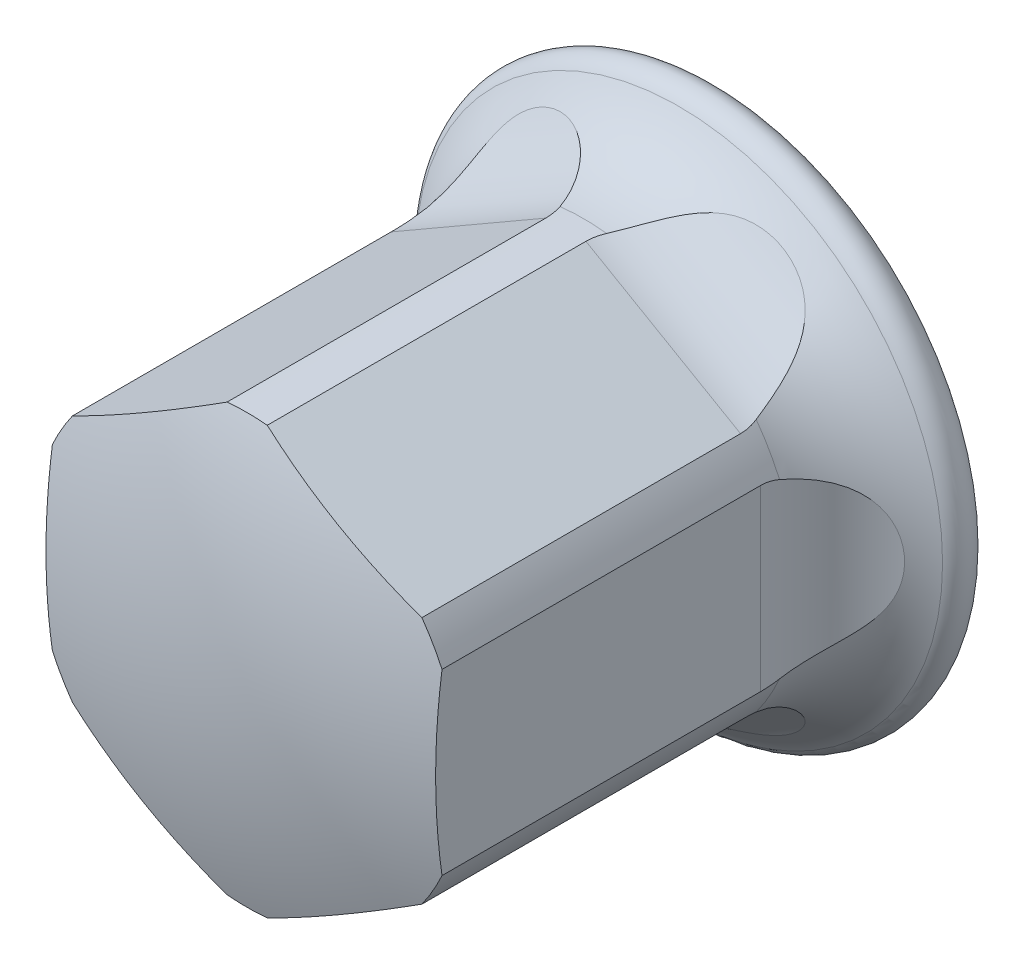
ISO-10303-21;
HEADER;
FILE_DESCRIPTION(('STEP AP214'),'2;1');
FILE_NAME('part.step','',(''),(''),'','','');
FILE_SCHEMA(('AUTOMOTIVE_DESIGN { 1 0 10303 214 1 1 1 1 }'));
ENDSEC;
DATA;
#1=APPLICATION_CONTEXT('core data for automotive mechanical design processes');
#2=APPLICATION_PROTOCOL_DEFINITION('international standard','automotive_design',2000,#1);
#3=PRODUCT_CONTEXT('',#1,'mechanical');
#4=PRODUCT('Part','Part','',(#3));
#5=PRODUCT_RELATED_PRODUCT_CATEGORY('part','',(#4));
#6=PRODUCT_DEFINITION_FORMATION('','',#4);
#7=PRODUCT_DEFINITION_CONTEXT('part definition',#1,'design');
#8=PRODUCT_DEFINITION('design','',#6,#7);
#9=PRODUCT_DEFINITION_SHAPE('','',#8);
#10=(LENGTH_UNIT() NAMED_UNIT(*) SI_UNIT(.MILLI.,.METRE.));
#11=(NAMED_UNIT(*) PLANE_ANGLE_UNIT() SI_UNIT($,.RADIAN.));
#12=(NAMED_UNIT(*) SI_UNIT($,.STERADIAN.) SOLID_ANGLE_UNIT());
#13=UNCERTAINTY_MEASURE_WITH_UNIT(LENGTH_MEASURE(1.E-05),#10,'distance_accuracy_value','');
#14=(GEOMETRIC_REPRESENTATION_CONTEXT(3) GLOBAL_UNCERTAINTY_ASSIGNED_CONTEXT((#13)) GLOBAL_UNIT_ASSIGNED_CONTEXT((#10,
#11,#12)) REPRESENTATION_CONTEXT('',''));
#15=CARTESIAN_POINT('',(0.,0.,0.));
#16=DIRECTION('',(0.,0.,1.));
#17=DIRECTION('',(1.,0.,0.));
#18=AXIS2_PLACEMENT_3D('',#15,#16,#17);
#19=CARTESIAN_POINT('',(0.,0.,0.));
#20=DIRECTION('',(0.,0.,-1.));
#21=DIRECTION('',(-1.,0.,0.));
#22=AXIS2_PLACEMENT_3D('',#19,#20,#21);
#23=CYLINDRICAL_SURFACE('',#22,5.5);
#24=CARTESIAN_POINT('',(4.48431348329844,3.18448309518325,3.9));
#25=CARTESIAN_POINT('',(4.48430942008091,3.18449254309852,3.82780073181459));
#26=CARTESIAN_POINT('',(4.48067330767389,3.18962874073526,3.75548124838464));
#27=CARTESIAN_POINT('',(4.46621411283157,3.2098404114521,3.61287392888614));
#28=CARTESIAN_POINT('',(4.45537240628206,3.22494164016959,3.54259185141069));
#29=CARTESIAN_POINT('',(4.42687457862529,3.26394798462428,3.40633785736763));
#30=CARTESIAN_POINT('',(4.40924898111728,3.28781364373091,3.34034816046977));
#31=CARTESIAN_POINT('',(4.36766077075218,3.34286167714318,3.21371755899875));
#32=CARTESIAN_POINT('',(4.3437002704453,3.37404161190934,3.15307488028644));
#33=CARTESIAN_POINT('',(4.28730463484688,3.44547237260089,3.03214120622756));
#34=CARTESIAN_POINT('',(4.25426302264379,3.48631742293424,2.97248714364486));
#35=CARTESIAN_POINT('',(4.18193387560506,3.57276055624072,2.86093723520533));
#36=CARTESIAN_POINT('',(4.14264153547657,3.61836228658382,2.80904741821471));
#37=CARTESIAN_POINT('',(4.0364064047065,3.73719559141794,2.68769493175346));
#38=CARTESIAN_POINT('',(3.96578347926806,3.81235433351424,2.62332599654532));
#39=CARTESIAN_POINT('',(3.81388688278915,3.96432421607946,2.51106603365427));
#40=CARTESIAN_POINT('',(3.7325888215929,4.04113879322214,2.46321367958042));
#41=CARTESIAN_POINT('',(3.59164894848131,4.16600052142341,2.39665736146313));
#42=CARTESIAN_POINT('',(3.5344927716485,4.21463091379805,2.37362682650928));
#43=CARTESIAN_POINT('',(3.41698429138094,4.31044777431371,2.33335535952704));
#44=CARTESIAN_POINT('',(3.35663107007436,4.35763382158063,2.31611610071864));
#45=CARTESIAN_POINT('',(3.23314328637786,4.45002613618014,2.28709721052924));
#46=CARTESIAN_POINT('',(3.17000800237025,4.49523188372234,2.2753190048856));
#47=CARTESIAN_POINT('',(3.04135107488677,4.58326019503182,2.25698889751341));
#48=CARTESIAN_POINT('',(2.97582852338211,4.62608183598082,2.25043900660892));
#49=CARTESIAN_POINT('',(2.77460208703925,4.75149307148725,2.23830596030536));
#50=CARTESIAN_POINT('',(2.63571459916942,4.82992074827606,2.24057556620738));
#51=CARTESIAN_POINT('',(2.35323352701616,4.9736702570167,2.26608371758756));
#52=CARTESIAN_POINT('',(2.20964200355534,5.03899774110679,2.289313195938));
#53=CARTESIAN_POINT('',(1.94401137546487,5.1466641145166,2.35342523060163));
#54=CARTESIAN_POINT('',(1.82200592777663,5.19098681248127,2.39109669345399));
#55=CARTESIAN_POINT('',(1.58180918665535,5.26912996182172,2.48502776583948));
#56=CARTESIAN_POINT('',(1.46361265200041,5.30296545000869,2.54126052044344));
#57=CARTESIAN_POINT('',(1.26543866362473,5.35316473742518,2.65782215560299));
#58=CARTESIAN_POINT('',(1.18333297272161,5.37178265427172,2.71355233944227));
#59=CARTESIAN_POINT('',(1.02791659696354,5.40366979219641,2.8374634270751));
#60=CARTESIAN_POINT('',(0.954593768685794,5.41694645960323,2.90562680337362));
#61=CARTESIAN_POINT('',(0.833447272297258,5.43676533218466,3.0403667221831));
#62=CARTESIAN_POINT('',(0.783420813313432,5.44410396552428,3.10483793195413));
#63=CARTESIAN_POINT('',(0.694373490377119,5.45617694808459,3.24125961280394));
#64=CARTESIAN_POINT('',(0.655348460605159,5.46091228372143,3.31320723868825));
#65=CARTESIAN_POINT('',(0.590466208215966,5.46831211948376,3.46356520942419));
#66=CARTESIAN_POINT('',(0.564700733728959,5.47096225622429,3.54201633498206));
#67=CARTESIAN_POINT('',(0.528634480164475,5.47456733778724,3.70244138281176));
#68=CARTESIAN_POINT('',(0.518324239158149,5.47552331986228,3.78441311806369));
#69=CARTESIAN_POINT('',(0.514196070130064,5.47591057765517,3.93910014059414));
#70=CARTESIAN_POINT('',(0.518584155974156,5.4755076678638,4.01177241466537));
#71=CARTESIAN_POINT('',(0.53971159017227,5.4734653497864,4.1552610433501));
#72=CARTESIAN_POINT('',(0.556448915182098,5.4718261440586,4.22607770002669));
#73=CARTESIAN_POINT('',(0.600856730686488,5.46712463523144,4.36261488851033));
#74=CARTESIAN_POINT('',(0.628313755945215,5.46408992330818,4.42840661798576));
#75=CARTESIAN_POINT('',(0.692751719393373,5.45629404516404,4.55500390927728));
#76=CARTESIAN_POINT('',(0.729734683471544,5.4515325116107,4.61580840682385));
#77=CARTESIAN_POINT('',(0.815753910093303,5.4393572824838,4.73744070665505));
#78=CARTESIAN_POINT('',(0.865630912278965,5.4317240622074,4.79764893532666));
#79=CARTESIAN_POINT('',(0.97280992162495,5.41355764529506,4.9105125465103));
#80=CARTESIAN_POINT('',(1.03011685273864,5.40302252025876,4.96316287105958));
#81=CARTESIAN_POINT('',(1.18100455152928,5.37250012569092,5.08597838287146));
#82=CARTESIAN_POINT('',(1.27812465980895,5.35043568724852,5.15129266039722));
#83=CARTESIAN_POINT('',(1.47950684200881,5.29829516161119,5.2658777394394));
#84=CARTESIAN_POINT('',(1.58378496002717,5.26820060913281,5.31511097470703));
#85=CARTESIAN_POINT('',(1.75840193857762,5.21184060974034,5.38438589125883));
#86=CARTESIAN_POINT('',(1.82788457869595,5.18790428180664,5.4086187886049));
#87=CARTESIAN_POINT('',(1.96736730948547,5.13663266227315,5.4513535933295));
#88=CARTESIAN_POINT('',(2.03736754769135,5.10929636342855,5.46985379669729));
#89=CARTESIAN_POINT('',(2.24713839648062,5.02227062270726,5.51729239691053));
#90=CARTESIAN_POINT('',(2.38672575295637,4.95754952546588,5.53818641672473));
#91=CARTESIAN_POINT('',(2.66299219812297,4.81487880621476,5.56032199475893));
#92=CARTESIAN_POINT('',(2.79960135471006,4.73675358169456,5.56127883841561));
#93=CARTESIAN_POINT('',(3.0646652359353,4.56971607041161,5.54290890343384));
#94=CARTESIAN_POINT('',(3.19312214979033,4.48080669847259,5.52358759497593));
#95=CARTESIAN_POINT('',(3.42445686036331,4.30599932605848,5.4665893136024));
#96=CARTESIAN_POINT('',(3.52857122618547,4.22095699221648,5.43131273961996));
#97=CARTESIAN_POINT('',(3.72563783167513,4.04804846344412,5.34154866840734));
#98=CARTESIAN_POINT('',(3.81860493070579,3.9601862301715,5.28708713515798));
#99=CARTESIAN_POINT('',(3.96850372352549,3.8091044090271,5.17318086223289));
#100=CARTESIAN_POINT('',(4.02856545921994,3.74533853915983,5.11858762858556));
#101=CARTESIAN_POINT('',(4.13951489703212,3.62232482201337,4.99649563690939));
#102=CARTESIAN_POINT('',(4.19041707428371,3.56306993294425,4.92901759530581));
#103=CARTESIAN_POINT('',(4.27267863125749,3.46374932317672,4.79535133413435));
#104=CARTESIAN_POINT('',(4.30591367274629,3.42218856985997,4.7314363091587));
#105=CARTESIAN_POINT('',(4.36456135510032,3.3470700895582,4.59565534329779));
#106=CARTESIAN_POINT('',(4.38997176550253,3.31351464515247,4.52378714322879));
#107=CARTESIAN_POINT('',(4.43230675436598,3.25667576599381,4.37296885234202));
#108=CARTESIAN_POINT('',(4.44915810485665,3.23348117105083,4.29396424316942));
#109=CARTESIAN_POINT('',(4.47336634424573,3.19991274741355,4.13202746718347));
#110=CARTESIAN_POINT('',(4.48075637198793,3.18949417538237,4.04911006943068));
#111=CARTESIAN_POINT('',(4.48397901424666,3.18495294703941,3.94396993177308));
#112=CARTESIAN_POINT('',(4.48431472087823,3.18448021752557,3.92199054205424));
#113=CARTESIAN_POINT('',(4.48431348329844,3.18448309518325,3.9));
#114=B_SPLINE_CURVE_WITH_KNOTS('',3,(#24,#25,#26,#27,#28,#29,#30,#31,#32,#33,#34,#35,#36,#37,
#38,#39,#40,#41,#42,#43,#44,#45,#46,#47,#48,#49,#50,#51,#52,#53,#54,#55,#56,#57,#58,#59,#60,#61,
#62,#63,#64,#65,#66,#67,#68,#69,#70,#71,#72,#73,#74,#75,#76,#77,#78,#79,#80,#81,#82,#83,#84,#85,
#86,#87,#88,#89,#90,#91,#92,#93,#94,#95,#96,#97,#98,#99,#100,#101,#102,#103,#104,#105,#106,#107,
#108,#109,#110,#111,#112,#113),.UNSPECIFIED.,.T.,.F.,(4,2,2,2,2,2,2,2,2,2,2,2,2,2,2,2,2,2,2,2,2,
2,2,2,2,2,2,2,2,2,2,2,2,2,2,2,2,2,2,2,2,2,2,2,4),(0.,0.216540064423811,0.433642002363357,
0.649778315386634,0.865842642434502,1.10343253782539,1.34120597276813,1.70392215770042,
2.06748197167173,2.30270699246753,2.53799991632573,2.77335423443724,3.0087990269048,
3.48525357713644,3.96150211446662,4.36553182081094,4.76897951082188,5.07081476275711,
5.37222775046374,5.61704420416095,5.86176783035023,6.10816276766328,6.35440679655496,
6.5717436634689,6.78904492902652,7.00222323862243,7.2154469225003,7.45023506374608,
7.68517960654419,8.04052252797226,8.3966897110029,8.62855599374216,8.8604911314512,
9.32420736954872,9.79454127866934,10.264748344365,10.680181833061,11.0950552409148,
11.4036375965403,11.7117279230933,11.960249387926,12.2088416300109,12.45952634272,
12.7093305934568,12.7752846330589),.UNSPECIFIED.);
#115=CARTESIAN_POINT('',(4.48431348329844,3.18448309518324,3.9));
#116=VERTEX_POINT('',#115);
#117=CARTESIAN_POINT('',(4.43573189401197,3.25181219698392,3.44949995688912));
#118=VERTEX_POINT('',#117);
#119=EDGE_CURVE('E339',#116,#118,#114,.T.);
#120=ORIENTED_EDGE('',*,*,#119,.F.);
#121=DIRECTION('',(0.,0.,-1.));
#122=VECTOR('',#121,1.);
#123=CARTESIAN_POINT('',(4.48431348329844,3.18448309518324,0.));
#124=LINE('',#123,#122);
#125=CARTESIAN_POINT('',(4.48431348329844,3.18448309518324,12.07767862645));
#126=VERTEX_POINT('',#125);
#127=EDGE_CURVE('E277',#116,#126,#124,.F.);
#128=ORIENTED_EDGE('',*,*,#127,.T.);
#129=CARTESIAN_POINT('',(0.,0.,12.07767862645));
#130=DIRECTION('',(0.,0.,-1.));
#131=DIRECTION('',(-1.,0.,0.));
#132=AXIS2_PLACEMENT_3D('',#129,#130,#131);
#133=CIRCLE('',#132,5.5);
#134=CARTESIAN_POINT('',(5.,2.29128784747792,12.07767862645));
#135=VERTEX_POINT('',#134);
#136=EDGE_CURVE('E314',#126,#135,#133,.T.);
#137=ORIENTED_EDGE('',*,*,#136,.T.);
#138=DIRECTION('',(0.,0.,-1.));
#139=VECTOR('',#138,1.);
#140=CARTESIAN_POINT('',(5.,2.29128784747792,0.));
#141=LINE('',#140,#139);
#142=CARTESIAN_POINT('',(5.,2.29128784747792,3.9));
#143=VERTEX_POINT('',#142);
#144=EDGE_CURVE('E32',#135,#143,#141,.T.);
#145=ORIENTED_EDGE('',*,*,#144,.T.);
#146=CARTESIAN_POINT('',(5.03401791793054,2.21555040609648,3.44949995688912));
#147=CARTESIAN_POINT('',(5.02893063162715,2.22710648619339,3.48298123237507));
#148=CARTESIAN_POINT('',(5.02435215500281,2.23740489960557,3.51696126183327));
#149=CARTESIAN_POINT('',(5.01630426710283,2.25539140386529,3.58574101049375));
#150=CARTESIAN_POINT('',(5.01283510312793,2.26307891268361,3.6205409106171));
#151=CARTESIAN_POINT('',(5.00424519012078,2.28204627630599,3.72571808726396));
#152=CARTESIAN_POINT('',(5.00091759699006,2.28928540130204,3.79702974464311));
#153=CARTESIAN_POINT('',(4.99941222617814,2.29257049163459,3.94005910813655));
#154=CARTESIAN_POINT('',(5.00124351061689,2.28859676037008,4.01177730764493));
#155=CARTESIAN_POINT('',(5.0098793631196,2.26962864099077,4.15339493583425));
#156=CARTESIAN_POINT('',(5.01668184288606,2.25463888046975,4.22329511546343));
#157=CARTESIAN_POINT('',(5.03453830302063,2.21447441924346,4.35902089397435));
#158=CARTESIAN_POINT('',(5.04556581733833,2.1893630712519,4.4248689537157));
#159=CARTESIAN_POINT('',(5.07090928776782,2.13000394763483,4.5516236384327));
#160=CARTESIAN_POINT('',(5.0852270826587,2.09575106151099,4.61252747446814));
#161=CARTESIAN_POINT('',(5.1175886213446,2.01552206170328,4.73430508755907));
#162=CARTESIAN_POINT('',(5.13586164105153,1.9687169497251,4.79456881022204));
#163=CARTESIAN_POINT('',(5.17362701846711,1.86722408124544,4.90755649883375));
#164=CARTESIAN_POINT('',(5.19311999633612,1.81253229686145,4.96027658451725));
#165=CARTESIAN_POINT('',(5.24204181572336,1.66717078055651,5.08322890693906));
#166=CARTESIAN_POINT('',(5.27145547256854,1.57240224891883,5.14863484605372));
#167=CARTESIAN_POINT('',(5.32697069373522,1.37265513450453,5.26345248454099));
#168=CARTESIAN_POINT('',(5.35306422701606,1.26765284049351,5.31282583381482));
#169=CARTESIAN_POINT('',(5.39164199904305,1.08877528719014,5.38237495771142));
#170=CARTESIAN_POINT('',(5.40569935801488,1.01681053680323,5.40672889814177));
#171=CARTESIAN_POINT('',(5.43114622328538,0.870721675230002,5.44971289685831));
#172=CARTESIAN_POINT('',(5.44253493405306,0.79659692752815,5.4683412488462));
#173=CARTESIAN_POINT('',(5.47226415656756,0.57189822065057,5.51617524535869));
#174=CARTESIAN_POINT('',(5.48617874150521,0.418949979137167,5.53734834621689));
#175=CARTESIAN_POINT('',(5.50115019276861,0.108885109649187,5.56009431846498));
#176=CARTESIAN_POINT('',(5.50201866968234,-0.0482598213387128,5.56138001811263));
#177=CARTESIAN_POINT('',(5.49036712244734,-0.360952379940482,5.54373721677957));
#178=CARTESIAN_POINT('',(5.47785045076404,-0.516500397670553,5.52481377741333));
#179=CARTESIAN_POINT('',(5.44254006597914,-0.804621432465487,5.46855241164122));
#180=CARTESIAN_POINT('',(5.42106444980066,-0.937807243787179,5.43353170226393));
#181=CARTESIAN_POINT('',(5.36999964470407,-1.19595375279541,5.3442168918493));
#182=CARTESIAN_POINT('',(5.34042153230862,-1.32092539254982,5.28994907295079));
#183=CARTESIAN_POINT('',(5.28451651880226,-1.52716889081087,5.17633624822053));
#184=CARTESIAN_POINT('',(5.25930324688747,-1.6114249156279,5.12186823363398));
#185=CARTESIAN_POINT('',(5.2081516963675,-1.76975640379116,4.9999726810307));
#186=CARTESIAN_POINT('',(5.18221452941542,-1.84384654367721,4.93256417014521));
#187=CARTESIAN_POINT('',(5.13717298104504,-1.96540820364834,4.79898320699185));
#188=CARTESIAN_POINT('',(5.11771816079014,-2.01525596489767,4.7350998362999));
#189=CARTESIAN_POINT('',(5.08182036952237,-2.10413886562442,4.59938598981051));
#190=CARTESIAN_POINT('',(5.06537616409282,-2.14317844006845,4.52755879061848));
#191=CARTESIAN_POINT('',(5.03714115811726,-2.20873424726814,4.37684068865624));
#192=CARTESIAN_POINT('',(5.02538492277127,-2.23515773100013,4.29790239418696));
#193=CARTESIAN_POINT('',(5.00818202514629,-2.27344895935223,4.1358772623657));
#194=CARTESIAN_POINT('',(5.00273287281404,-2.28532244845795,4.05279207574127));
#195=CARTESIAN_POINT('',(4.99910874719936,-2.29323277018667,3.89620251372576));
#196=CARTESIAN_POINT('',(5.00010817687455,-2.2910668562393,3.82280152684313));
#197=CARTESIAN_POINT('',(5.00737450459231,-2.27514496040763,3.67763834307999));
#198=CARTESIAN_POINT('',(5.01363241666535,-2.26140875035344,3.60587356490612));
#199=CARTESIAN_POINT('',(5.02573218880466,-2.23429528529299,3.50678299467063));
#200=CARTESIAN_POINT('',(5.02968930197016,-2.22537825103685,3.47794309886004));
#201=CARTESIAN_POINT('',(5.03401791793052,-2.21555040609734,3.44949995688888));
#202=B_SPLINE_CURVE_WITH_KNOTS('',3,(#146,#147,#148,#149,#150,#151,#152,#153,#154,#155,#156,
#157,#158,#159,#160,#161,#162,#163,#164,#165,#166,#167,#168,#169,#170,#171,#172,#173,#174,#175,
#176,#177,#178,#179,#180,#181,#182,#183,#184,#185,#186,#187,#188,#189,#190,#191,#192,#193,#194,
#195,#196,#197,#198,#199,#200,#201),.UNSPECIFIED.,.F.,.F.,(4,2,2,2,2,2,2,2,2,2,2,2,2,2,2,2,2,2,
2,2,2,2,2,2,2,2,2,4),(0.,0.10729305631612,0.214610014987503,0.428746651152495,0.643259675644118,
0.857682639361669,1.07078383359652,1.28400441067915,1.51851227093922,1.75314032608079,
2.1077193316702,2.4631403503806,2.69465054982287,2.92622967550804,3.38922713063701,
3.85890407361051,4.32846340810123,4.74507126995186,5.16111242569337,5.47038480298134,
5.77920587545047,6.02821625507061,6.27712430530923,6.527835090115,6.77844685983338,
6.99766992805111,7.21651913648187,7.30776940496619),.UNSPECIFIED.);
#203=CARTESIAN_POINT('',(5.03401791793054,2.21555040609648,3.44949995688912));
#204=VERTEX_POINT('',#203);
#205=EDGE_CURVE('E368',#204,#143,#202,.T.);
#206=ORIENTED_EDGE('',*,*,#205,.F.);
#207=CARTESIAN_POINT('',(0.,0.,3.44949995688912));
#208=DIRECTION('',(0.,0.,-1.));
#209=DIRECTION('',(-1.,0.,0.));
#210=AXIS2_PLACEMENT_3D('',#207,#208,#209);
#211=CIRCLE('',#210,5.5);
#212=EDGE_CURVE('E321',#118,#204,#211,.T.);
#213=ORIENTED_EDGE('',*,*,#212,.F.);
#214=EDGE_LOOP('',(#120,#128,#137,#145,#206,#213));
#215=FACE_BOUND('',#214,.T.);
#216=ADVANCED_FACE('F16',(#215),#23,.T.);
#217=CARTESIAN_POINT('',(0.515686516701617,-5.47577094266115,3.9));
#218=CARTESIAN_POINT('',(0.515696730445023,-5.47577214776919,3.82780073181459));
#219=CARTESIAN_POINT('',(0.521962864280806,-5.47519128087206,3.75548124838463));
#220=CARTESIAN_POINT('',(0.546696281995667,-5.47277508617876,3.61287392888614));
#221=CARTESIAN_POINT('',(0.565195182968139,-5.47093650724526,3.54259185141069));
#222=CARTESIAN_POINT('',(0.613224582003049,-5.46575983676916,3.40633785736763));
#223=CARTESIAN_POINT('',(0.642705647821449,-5.46242845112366,3.34034816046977));
#224=CARTESIAN_POINT('',(0.711172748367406,-5.45393602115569,3.21371755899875));
#225=CARTESIAN_POINT('',(0.75015561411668,-5.44877558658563,3.15307488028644));
#226=CARTESIAN_POINT('',(0.840214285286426,-5.43565091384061,3.03214120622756));
#227=CARTESIAN_POINT('',(0.892107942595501,-5.42745856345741,2.97248714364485));
#228=CARTESIAN_POINT('',(1.003134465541,-5.40804125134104,2.86093723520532));
#229=CARTESIAN_POINT('',(1.0622728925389,-5.39681395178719,2.80904741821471));
#230=CARTESIAN_POINT('',(1.21830311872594,-5.364228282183,2.68769493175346));
#231=CARTESIAN_POINT('',(1.31870396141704,-5.34064640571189,2.62332599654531));
#232=CARTESIAN_POINT('',(1.52626203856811,-5.28508503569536,2.51106603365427));
#233=CARTESIAN_POINT('',(1.63343444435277,-5.25308613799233,2.46321367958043));
#234=CARTESIAN_POINT('',(1.81203780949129,-5.19345949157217,2.39665736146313));
#235=CARTESIAN_POINT('',(1.88273105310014,-5.16827598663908,2.37362682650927));
#236=CARTESIAN_POINT('',(2.02446512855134,-5.1144190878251,2.33335535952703));
#237=CARTESIAN_POINT('',(2.09550605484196,-5.08574468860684,2.31611610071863));
#238=CARTESIAN_POINT('',(2.23726403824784,-5.02499728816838,2.28709721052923));
#239=CARTESIAN_POINT('',(2.30798100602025,-4.99292340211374,2.27531900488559));
#240=CARTESIAN_POINT('',(2.44854422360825,-4.92551739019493,2.25698889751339));
#241=CARTESIAN_POINT('',(2.51839012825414,-4.89018401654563,2.25043900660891));
#242=CARTESIAN_POINT('',(2.72761266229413,-4.77862242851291,2.23830596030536));
#243=CARTESIAN_POINT('',(2.86497676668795,-4.69755617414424,2.24057556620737));
#244=CARTESIAN_POINT('',(3.13070802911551,-4.52479514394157,2.26608371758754));
#245=CARTESIAN_POINT('',(3.25907905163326,-4.43310497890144,2.289313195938));
#246=CARTESIAN_POINT('',(3.48513618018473,-4.25689529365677,2.35342523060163));
#247=CARTESIAN_POINT('',(3.58452348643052,-4.17339682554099,2.39109669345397));
#248=CARTESIAN_POINT('',(3.77229580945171,-4.00445192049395,2.48502776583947));
#249=CARTESIAN_POINT('',(3.86069646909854,-3.91900846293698,2.54126052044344));
#250=CARTESIAN_POINT('',(4.00325732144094,-3.77248439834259,2.65782215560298));
#251=CARTESIAN_POINT('',(4.06043375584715,-3.71068774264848,2.71355233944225));
#252=CARTESIAN_POINT('',(4.16575701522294,-3.59203678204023,2.83746342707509));
#253=CARTESIAN_POINT('',(4.21391636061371,-3.5351756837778,2.90562680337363));
#254=CARTESIAN_POINT('',(4.29165325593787,-3.44016917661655,3.04036672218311));
#255=CARTESIAN_POINT('',(4.32302192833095,-3.40051430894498,3.10483793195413));
#256=CARTESIAN_POINT('',(4.37800109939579,-3.32943355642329,3.24125961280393));
#257=CARTESIAN_POINT('',(4.40161453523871,-3.29800455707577,3.31320723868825));
#258=CARTESIAN_POINT('',(4.44046410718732,-3.24551479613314,3.4635652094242));
#259=CARTESIAN_POINT('',(4.45564193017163,-3.22452630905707,3.54201633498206));
#260=CARTESIAN_POINT('',(4.4767971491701,-3.19509455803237,3.70244138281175));
#261=CARTESIAN_POINT('',(4.48278017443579,-3.18664361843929,3.78441311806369));
#262=CARTESIAN_POINT('',(4.48517963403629,-3.1832621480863,3.93910014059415));
#263=CARTESIAN_POINT('',(4.4826366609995,-3.18686088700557,4.01177241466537));
#264=CARTESIAN_POINT('',(4.47030424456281,-3.20413662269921,4.1552610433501));
#265=CARTESIAN_POINT('',(4.46051598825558,-3.21781196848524,4.22607770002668));
#266=CARTESIAN_POINT('',(4.43424045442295,-3.25391951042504,4.36261488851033));
#267=CARTESIAN_POINT('',(4.41788380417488,-3.2761806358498,4.42840661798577));
#268=CARTESIAN_POINT('',(4.37891339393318,-3.32808761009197,4.55500390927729));
#269=CARTESIAN_POINT('',(4.35629830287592,-3.35773502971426,4.61580840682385));
#270=CARTESIAN_POINT('',(4.30274463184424,-3.42614225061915,4.73744070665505));
#271=CARTESIAN_POINT('',(4.27119556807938,-3.46552039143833,4.79764893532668));
#272=CARTESIAN_POINT('',(4.20187348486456,-3.54925692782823,4.91051254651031));
#273=CARTESIAN_POINT('',(4.16409633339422,-3.59361862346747,4.96316287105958));
#274=CARTESIAN_POINT('',(4.06221931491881,-3.70903000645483,5.08597838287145));
#275=CARTESIAN_POINT('',(3.99455089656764,-3.78210626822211,5.15129266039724));
#276=CARTESIAN_POINT('',(3.84870478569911,-3.93043809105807,5.26587773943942));
#277=CARTESIAN_POINT('',(3.77050307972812,-4.00569831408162,5.31511097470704));
#278=CARTESIAN_POINT('',(3.63438539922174,-4.12874105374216,5.38438589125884));
#279=CARTESIAN_POINT('',(3.57891461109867,-4.1769466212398,5.40861878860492));
#280=CARTESIAN_POINT('',(3.46477072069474,-4.272106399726,5.45135359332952));
#281=CARTESIAN_POINT('',(3.40609667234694,-4.31906023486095,5.4698537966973));
#282=CARTESIAN_POINT('',(3.22584474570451,-4.45721424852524,5.51729239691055));
#283=CARTESIAN_POINT('',(3.1000009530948,-4.54573989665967,5.53818641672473));
#284=CARTESIAN_POINT('',(2.83831126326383,-4.71365829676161,5.56032199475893));
#285=CARTESIAN_POINT('',(2.70234825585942,-4.7929026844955,5.56127883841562));
#286=CARTESIAN_POINT('',(2.42515758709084,-4.93893598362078,5.54290890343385));
#287=CARTESIAN_POINT('',(2.28393135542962,-5.00572824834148,5.52358759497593));
#288=CARTESIAN_POINT('',(2.0168763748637,-5.11866629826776,5.4665893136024));
#289=CARTESIAN_POINT('',(1.89117037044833,-5.16631081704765,5.43131273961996));
#290=CARTESIAN_POINT('',(1.64289388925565,-5.25052123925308,5.34154866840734));
#291=CARTESIAN_POINT('',(1.520319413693,-5.28710199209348,5.28708713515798));
#292=CARTESIAN_POINT('',(1.31452932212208,-5.34137724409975,5.17318086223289));
#293=CARTESIAN_POINT('',(1.22927559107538,-5.36150929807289,5.11858762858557));
#294=CARTESIAN_POINT('',(1.06726786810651,-5.39608747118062,4.9964956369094));
#295=CARTESIAN_POINT('',(0.99050054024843,-5.41054260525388,4.92901759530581));
#296=CARTESIAN_POINT('',(0.863355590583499,-5.43212289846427,4.79535133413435));
#297=CARTESIAN_POINT('',(0.810745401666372,-5.44012491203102,4.73143630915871));
#298=CARTESIAN_POINT('',(0.716367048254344,-5.45335605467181,4.5956553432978));
#299=CARTESIAN_POINT('',(0.674601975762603,-5.45858439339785,4.52378714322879));
#300=CARTESIAN_POINT('',(0.604210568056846,-5.46682812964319,4.37296885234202));
#301=CARTESIAN_POINT('',(0.575697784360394,-5.4698245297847,4.29396424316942));
#302=CARTESIAN_POINT('',(0.534522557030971,-5.4740052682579,4.13202746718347));
#303=CARTESIAN_POINT('',(0.521804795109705,-5.47519593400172,4.04911006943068));
#304=CARTESIAN_POINT('',(0.516260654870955,-5.47571620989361,3.94396993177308));
#305=CARTESIAN_POINT('',(0.515683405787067,-5.47577057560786,3.92199054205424));
#306=CARTESIAN_POINT('',(0.515686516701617,-5.47577094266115,3.9));
#307=B_SPLINE_CURVE_WITH_KNOTS('',3,(#217,#218,#219,#220,#221,#222,#223,#224,#225,#226,#227,
#228,#229,#230,#231,#232,#233,#234,#235,#236,#237,#238,#239,#240,#241,#242,#243,#244,#245,#246,
#247,#248,#249,#250,#251,#252,#253,#254,#255,#256,#257,#258,#259,#260,#261,#262,#263,#264,#265,
#266,#267,#268,#269,#270,#271,#272,#273,#274,#275,#276,#277,#278,#279,#280,#281,#282,#283,#284,
#285,#286,#287,#288,#289,#290,#291,#292,#293,#294,#295,#296,#297,#298,#299,#300,#301,#302,#303,
#304,#305,#306),.UNSPECIFIED.,.T.,.F.,(4,2,2,2,2,2,2,2,2,2,2,2,2,2,2,2,2,2,2,2,2,2,2,2,2,2,2,2,
2,2,2,2,2,2,2,2,2,2,2,2,2,2,2,2,4),(0.,0.216540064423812,0.433642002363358,0.649778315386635,
0.865842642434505,1.10343253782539,1.34120597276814,1.70392215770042,2.06748197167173,
2.30270699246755,2.53799991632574,2.77335423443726,3.00879902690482,3.48525357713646,
3.96150211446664,4.36553182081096,4.7689795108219,5.07081476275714,5.37222775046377,
5.61704420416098,5.86176783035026,6.10816276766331,6.35440679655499,6.57174366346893,
6.78904492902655,7.00222323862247,7.21544692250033,7.45023506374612,7.68517960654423,
8.04052252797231,8.39668971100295,8.62855599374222,8.86049113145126,9.32420736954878,
9.7945412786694,10.264748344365,10.680181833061,11.0950552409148,11.4036375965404,
11.7117279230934,11.9602493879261,12.208841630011,12.45952634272,12.7093305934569,
12.7752846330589),.UNSPECIFIED.);
#308=CARTESIAN_POINT('',(0.51568651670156,-5.47577094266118,3.9));
#309=VERTEX_POINT('',#308);
#310=CARTESIAN_POINT('',(0.598286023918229,-5.46736260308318,3.44949995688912));
#311=VERTEX_POINT('',#310);
#312=EDGE_CURVE('E297',#309,#311,#307,.T.);
#313=ORIENTED_EDGE('',*,*,#312,.F.);
#314=DIRECTION('',(0.,0.,-1.));
#315=VECTOR('',#314,1.);
#316=CARTESIAN_POINT('',(0.515686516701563,-5.47577094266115,0.));
#317=LINE('',#316,#315);
#318=CARTESIAN_POINT('',(0.51568651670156,-5.47577094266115,12.07767862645));
#319=VERTEX_POINT('',#318);
#320=EDGE_CURVE('E181',#309,#319,#317,.F.);
#321=ORIENTED_EDGE('',*,*,#320,.T.);
#322=CARTESIAN_POINT('',(-0.515686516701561,-5.47577094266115,12.07767862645));
#323=VERTEX_POINT('',#322);
#324=EDGE_CURVE('E295',#319,#323,#133,.T.);
#325=ORIENTED_EDGE('',*,*,#324,.T.);
#326=DIRECTION('',(0.,0.,-1.));
#327=VECTOR('',#326,1.);
#328=CARTESIAN_POINT('',(-0.515686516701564,-5.47577094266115,0.));
#329=LINE('',#328,#327);
#330=CARTESIAN_POINT('',(-0.515686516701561,-5.47577094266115,3.9));
#331=VERTEX_POINT('',#330);
#332=EDGE_CURVE('E268',#323,#331,#329,.T.);
#333=ORIENTED_EDGE('',*,*,#332,.T.);
#334=CARTESIAN_POINT('',(-4.48431348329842,-3.18448309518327,3.9));
#335=CARTESIAN_POINT('',(-4.48430942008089,-3.18449254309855,3.82780073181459));
#336=CARTESIAN_POINT('',(-4.48067330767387,-3.18962874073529,3.75548124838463));
#337=CARTESIAN_POINT('',(-4.46621411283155,-3.20984041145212,3.61287392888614));
#338=CARTESIAN_POINT('',(-4.45537240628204,-3.22494164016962,3.54259185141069));
#339=CARTESIAN_POINT('',(-4.42687457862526,-3.26394798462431,3.40633785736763));
#340=CARTESIAN_POINT('',(-4.40924898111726,-3.28781364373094,3.34034816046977));
#341=CARTESIAN_POINT('',(-4.36766077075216,-3.34286167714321,3.21371755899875));
#342=CARTESIAN_POINT('',(-4.34370027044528,-3.37404161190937,3.15307488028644));
#343=CARTESIAN_POINT('',(-4.28730463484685,-3.44547237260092,3.03214120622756));
#344=CARTESIAN_POINT('',(-4.25426302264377,-3.48631742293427,2.97248714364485));
#345=CARTESIAN_POINT('',(-4.18193387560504,-3.57276055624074,2.86093723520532));
#346=CARTESIAN_POINT('',(-4.14264153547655,-3.61836228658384,2.80904741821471));
#347=CARTESIAN_POINT('',(-4.03640640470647,-3.73719559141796,2.68769493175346));
#348=CARTESIAN_POINT('',(-3.96578347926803,-3.81235433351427,2.62332599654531));
#349=CARTESIAN_POINT('',(-3.81388688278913,-3.96432421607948,2.51106603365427));
#350=CARTESIAN_POINT('',(-3.73258882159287,-4.04113879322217,2.46321367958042));
#351=CARTESIAN_POINT('',(-3.59164894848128,-4.16600052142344,2.39665736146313));
#352=CARTESIAN_POINT('',(-3.53449277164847,-4.21463091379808,2.37362682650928));
#353=CARTESIAN_POINT('',(-3.41698429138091,-4.31044777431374,2.33335535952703));
#354=CARTESIAN_POINT('',(-3.35663107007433,-4.35763382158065,2.31611610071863));
#355=CARTESIAN_POINT('',(-3.23314328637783,-4.45002613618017,2.28709721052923));
#356=CARTESIAN_POINT('',(-3.17000800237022,-4.49523188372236,2.27531900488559));
#357=CARTESIAN_POINT('',(-3.04135107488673,-4.58326019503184,2.2569888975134));
#358=CARTESIAN_POINT('',(-2.97582852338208,-4.62608183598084,2.25043900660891));
#359=CARTESIAN_POINT('',(-2.77460208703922,-4.75149307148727,2.23830596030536));
#360=CARTESIAN_POINT('',(-2.63571459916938,-4.82992074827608,2.24057556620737));
#361=CARTESIAN_POINT('',(-2.35323352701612,-4.97367025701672,2.26608371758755));
#362=CARTESIAN_POINT('',(-2.2096420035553,-5.03899774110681,2.289313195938));
#363=CARTESIAN_POINT('',(-1.94401137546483,-5.14666411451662,2.35342523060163));
#364=CARTESIAN_POINT('',(-1.82200592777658,-5.19098681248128,2.39109669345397));
#365=CARTESIAN_POINT('',(-1.58180918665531,-5.26912996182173,2.48502776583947));
#366=CARTESIAN_POINT('',(-1.46361265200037,-5.3029654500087,2.54126052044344));
#367=CARTESIAN_POINT('',(-1.26543866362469,-5.35316473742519,2.65782215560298));
#368=CARTESIAN_POINT('',(-1.18333297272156,-5.37178265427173,2.71355233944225));
#369=CARTESIAN_POINT('',(-1.02791659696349,-5.40366979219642,2.83746342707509));
#370=CARTESIAN_POINT('',(-0.954593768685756,-5.41694645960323,2.90562680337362));
#371=CARTESIAN_POINT('',(-0.833447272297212,-5.43676533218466,3.0403667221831));
#372=CARTESIAN_POINT('',(-0.783420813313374,-5.44410396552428,3.10483793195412));
#373=CARTESIAN_POINT('',(-0.694373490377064,-5.4561769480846,3.24125961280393));
#374=CARTESIAN_POINT('',(-0.65534846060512,-5.46091228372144,3.31320723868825));
#375=CARTESIAN_POINT('',(-0.590466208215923,-5.46831211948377,3.4635652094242));
#376=CARTESIAN_POINT('',(-0.564700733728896,-5.4709622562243,3.54201633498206));
#377=CARTESIAN_POINT('',(-0.528634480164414,-5.47456733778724,3.70244138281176));
#378=CARTESIAN_POINT('',(-0.51832423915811,-5.47552331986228,3.78441311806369));
#379=CARTESIAN_POINT('',(-0.514196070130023,-5.47591057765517,3.93910014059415));
#380=CARTESIAN_POINT('',(-0.518584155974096,-5.47550766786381,4.01177241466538));
#381=CARTESIAN_POINT('',(-0.539711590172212,-5.4734653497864,4.15526104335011));
#382=CARTESIAN_POINT('',(-0.55644891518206,-5.4718261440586,4.22607770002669));
#383=CARTESIAN_POINT('',(-0.600856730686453,-5.46712463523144,4.36261488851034));
#384=CARTESIAN_POINT('',(-0.628313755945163,-5.46408992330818,4.42840661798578));
#385=CARTESIAN_POINT('',(-0.692751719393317,-5.45629404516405,4.5550039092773));
#386=CARTESIAN_POINT('',(-0.729734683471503,-5.4515325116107,4.61580840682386));
#387=CARTESIAN_POINT('',(-0.815753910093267,-5.4393572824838,4.73744070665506));
#388=CARTESIAN_POINT('',(-0.865630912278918,-5.43172406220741,4.79764893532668));
#389=CARTESIAN_POINT('',(-0.972809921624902,-5.41355764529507,4.91051254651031));
#390=CARTESIAN_POINT('',(-1.03011685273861,-5.40302252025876,4.96316287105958));
#391=CARTESIAN_POINT('',(-1.18100455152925,-5.37250012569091,5.08597838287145));
#392=CARTESIAN_POINT('',(-1.27812465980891,-5.35043568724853,5.15129266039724));
#393=CARTESIAN_POINT('',(-1.47950684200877,-5.2982951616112,5.26587773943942));
#394=CARTESIAN_POINT('',(-1.58378496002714,-5.26820060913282,5.31511097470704));
#395=CARTESIAN_POINT('',(-1.75840193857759,-5.21184060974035,5.38438589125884));
#396=CARTESIAN_POINT('',(-1.82788457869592,-5.18790428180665,5.40861878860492));
#397=CARTESIAN_POINT('',(-1.96736730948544,-5.13663266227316,5.45135359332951));
#398=CARTESIAN_POINT('',(-2.03736754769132,-5.10929636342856,5.4698537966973));
#399=CARTESIAN_POINT('',(-2.24713839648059,-5.02227062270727,5.51729239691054));
#400=CARTESIAN_POINT('',(-2.38672575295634,-4.95754952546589,5.53818641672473));
#401=CARTESIAN_POINT('',(-2.66299219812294,-4.81487880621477,5.56032199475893));
#402=CARTESIAN_POINT('',(-2.79960135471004,-4.73675358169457,5.56127883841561));
#403=CARTESIAN_POINT('',(-3.06466523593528,-4.56971607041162,5.54290890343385));
#404=CARTESIAN_POINT('',(-3.19312214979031,-4.48080669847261,5.52358759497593));
#405=CARTESIAN_POINT('',(-3.42445686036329,-4.3059993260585,5.4665893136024));
#406=CARTESIAN_POINT('',(-3.52857122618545,-4.22095699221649,5.43131273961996));
#407=CARTESIAN_POINT('',(-3.72563783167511,-4.04804846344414,5.34154866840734));
#408=CARTESIAN_POINT('',(-3.81860493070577,-3.96018623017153,5.28708713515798));
#409=CARTESIAN_POINT('',(-3.96850372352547,-3.80910440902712,5.17318086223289));
#410=CARTESIAN_POINT('',(-4.02856545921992,-3.74533853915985,5.11858762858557));
#411=CARTESIAN_POINT('',(-4.1395148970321,-3.62232482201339,4.9964956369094));
#412=CARTESIAN_POINT('',(-4.19041707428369,-3.56306993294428,4.92901759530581));
#413=CARTESIAN_POINT('',(-4.27267863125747,-3.46374932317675,4.79535133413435));
#414=CARTESIAN_POINT('',(-4.30591367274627,-3.42218856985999,4.7314363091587));
#415=CARTESIAN_POINT('',(-4.3645613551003,-3.34707008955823,4.59565534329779));
#416=CARTESIAN_POINT('',(-4.38997176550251,-3.3135146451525,4.52378714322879));
#417=CARTESIAN_POINT('',(-4.43230675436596,-3.25667576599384,4.37296885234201));
#418=CARTESIAN_POINT('',(-4.44915810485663,-3.23348117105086,4.29396424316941));
#419=CARTESIAN_POINT('',(-4.47336634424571,-3.19991274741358,4.13202746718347));
#420=CARTESIAN_POINT('',(-4.48075637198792,-3.18949417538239,4.04911006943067));
#421=CARTESIAN_POINT('',(-4.48397901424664,-3.18495294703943,3.94396993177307));
#422=CARTESIAN_POINT('',(-4.48431472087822,-3.1844802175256,3.92199054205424));
#423=CARTESIAN_POINT('',(-4.48431348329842,-3.18448309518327,3.9));
#424=B_SPLINE_CURVE_WITH_KNOTS('',3,(#334,#335,#336,#337,#338,#339,#340,#341,#342,#343,#344,
#345,#346,#347,#348,#349,#350,#351,#352,#353,#354,#355,#356,#357,#358,#359,#360,#361,#362,#363,
#364,#365,#366,#367,#368,#369,#370,#371,#372,#373,#374,#375,#376,#377,#378,#379,#380,#381,#382,
#383,#384,#385,#386,#387,#388,#389,#390,#391,#392,#393,#394,#395,#396,#397,#398,#399,#400,#401,
#402,#403,#404,#405,#406,#407,#408,#409,#410,#411,#412,#413,#414,#415,#416,#417,#418,#419,#420,
#421,#422,#423),.UNSPECIFIED.,.T.,.F.,(4,2,2,2,2,2,2,2,2,2,2,2,2,2,2,2,2,2,2,2,2,2,2,2,2,2,2,2,
2,2,2,2,2,2,2,2,2,2,2,2,2,2,2,2,4),(0.,0.216540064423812,0.433642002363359,0.649778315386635,
0.865842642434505,1.10343253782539,1.34120597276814,1.70392215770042,2.06748197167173,
2.30270699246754,2.53799991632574,2.77335423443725,3.00879902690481,3.48525357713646,
3.96150211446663,4.36553182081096,4.7689795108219,5.07081476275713,5.37222775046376,
5.61704420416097,5.86176783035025,6.1081627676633,6.35440679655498,6.57174366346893,
6.78904492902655,7.00222323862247,7.21544692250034,7.45023506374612,7.68517960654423,
8.0405225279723,8.39668971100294,8.62855599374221,8.86049113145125,9.32420736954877,
9.79454127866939,10.264748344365,10.680181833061,11.0950552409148,11.4036375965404,
11.7117279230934,11.9602493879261,12.208841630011,12.45952634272,12.7093305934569,
12.7752846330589),.UNSPECIFIED.);
#425=CARTESIAN_POINT('',(-0.598286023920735,-5.46736260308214,3.44949995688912));
#426=VERTEX_POINT('',#425);
#427=EDGE_CURVE('E516',#426,#331,#424,.T.);
#428=ORIENTED_EDGE('',*,*,#427,.F.);
#429=EDGE_CURVE('E329',#311,#426,#211,.T.);
#430=ORIENTED_EDGE('',*,*,#429,.F.);
#431=EDGE_LOOP('',(#313,#321,#325,#333,#428,#430));
#432=FACE_BOUND('',#431,.T.);
#433=ADVANCED_FACE('F207',(#432),#23,.T.);
#434=CARTESIAN_POINT('',(-4.48431348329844,-3.18448309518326,3.9));
#435=VERTEX_POINT('',#434);
#436=CARTESIAN_POINT('',(-4.43573189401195,-3.25181219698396,3.44949995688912));
#437=VERTEX_POINT('',#436);
#438=EDGE_CURVE('E515',#435,#437,#424,.T.);
#439=ORIENTED_EDGE('',*,*,#438,.F.);
#440=DIRECTION('',(0.,0.,-1.));
#441=VECTOR('',#440,1.);
#442=CARTESIAN_POINT('',(-4.48431348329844,-3.18448309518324,0.));
#443=LINE('',#442,#441);
#444=CARTESIAN_POINT('',(-4.48431348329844,-3.18448309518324,12.07767862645));
#445=VERTEX_POINT('',#444);
#446=EDGE_CURVE('E274',#435,#445,#443,.F.);
#447=ORIENTED_EDGE('',*,*,#446,.T.);
#448=CARTESIAN_POINT('',(-5.,-2.29128784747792,12.07767862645));
#449=VERTEX_POINT('',#448);
#450=EDGE_CURVE('E309',#445,#449,#133,.T.);
#451=ORIENTED_EDGE('',*,*,#450,.T.);
#452=DIRECTION('',(0.,0.,-1.));
#453=VECTOR('',#452,1.);
#454=CARTESIAN_POINT('',(-5.,-2.29128784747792,0.));
#455=LINE('',#454,#453);
#456=CARTESIAN_POINT('',(-5.,-2.29128784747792,3.9));
#457=VERTEX_POINT('',#456);
#458=EDGE_CURVE('E269',#449,#457,#455,.T.);
#459=ORIENTED_EDGE('',*,*,#458,.T.);
#460=CARTESIAN_POINT('',(-5.5,0.,5.5583123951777));
#461=CARTESIAN_POINT('',(-5.49999786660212,0.152283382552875,5.55831786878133));
#462=CARTESIAN_POINT('',(-5.49364372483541,0.304601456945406,5.54884450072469));
#463=CARTESIAN_POINT('',(-5.46859290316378,0.606094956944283,5.510133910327));
#464=CARTESIAN_POINT('',(-5.44987399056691,0.75526422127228,5.48086108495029));
#465=CARTESIAN_POINT('',(-5.41363997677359,0.973688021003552,5.42028618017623));
#466=CARTESIAN_POINT('',(-5.4001163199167,1.04594729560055,5.39716246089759));
#467=CARTESIAN_POINT('',(-5.37069487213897,1.18779983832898,5.34487499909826));
#468=CARTESIAN_POINT('',(-5.35479654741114,1.25739250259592,5.31570989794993));
#469=CARTESIAN_POINT('',(-5.32117581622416,1.392817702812,5.25100833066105));
#470=CARTESIAN_POINT('',(-5.30345953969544,1.45866178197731,5.21549299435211));
#471=CARTESIAN_POINT('',(-5.26684819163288,1.58577485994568,5.13763094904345));
#472=CARTESIAN_POINT('',(-5.24795410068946,1.64704757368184,5.09528987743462));
#473=CARTESIAN_POINT('',(-5.20646279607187,1.7742507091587,4.99525278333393));
#474=CARTESIAN_POINT('',(-5.18380216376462,1.83908535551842,4.93616542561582));
#475=CARTESIAN_POINT('',(-5.13987722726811,1.95849859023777,4.80789845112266));
#476=CARTESIAN_POINT('',(-5.11861229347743,2.01308182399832,4.73872343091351));
#477=CARTESIAN_POINT('',(-5.07946565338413,2.10992759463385,4.5902307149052));
#478=CARTESIAN_POINT('',(-5.0616190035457,2.15206464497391,4.51082059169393));
#479=CARTESIAN_POINT('',(-5.03190787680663,2.22065934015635,4.34444021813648));
#480=CARTESIAN_POINT('',(-5.02003658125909,2.24713486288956,4.25747871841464));
#481=CARTESIAN_POINT('',(-5.00522070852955,2.27992003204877,4.0926306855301));
#482=CARTESIAN_POINT('',(-5.0012120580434,2.28864102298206,4.01531497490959));
#483=CARTESIAN_POINT('',(-4.99926389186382,2.29289592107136,3.86025741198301));
#484=CARTESIAN_POINT('',(-5.0013213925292,2.28843631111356,3.78251578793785));
#485=CARTESIAN_POINT('',(-5.01080624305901,2.26758208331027,3.63613355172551));
#486=CARTESIAN_POINT('',(-5.01773876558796,2.25228636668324,3.56729924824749));
#487=CARTESIAN_POINT('',(-5.03576048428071,2.21169759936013,3.43324541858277));
#488=CARTESIAN_POINT('',(-5.04684966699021,2.18640458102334,3.36802588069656));
#489=CARTESIAN_POINT('',(-5.0728151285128,2.12548431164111,3.23963731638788));
#490=CARTESIAN_POINT('',(-5.0878420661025,2.08943544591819,3.17670037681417));
#491=CARTESIAN_POINT('',(-5.12016796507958,2.00892168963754,3.05714119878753));
#492=CARTESIAN_POINT('',(-5.13746814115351,1.9644522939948,3.00052236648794));
#493=CARTESIAN_POINT('',(-5.180815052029,1.84782926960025,2.87108885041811));
#494=CARTESIAN_POINT('',(-5.20742527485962,1.77199162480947,2.8017720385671));
#495=CARTESIAN_POINT('',(-5.25989668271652,1.60960137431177,2.67670394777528));
#496=CARTESIAN_POINT('',(-5.28575613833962,1.52302613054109,2.62098209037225));
#497=CARTESIAN_POINT('',(-5.34242620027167,1.31292563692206,2.50620834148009));
#498=CARTESIAN_POINT('',(-5.37213096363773,1.18650944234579,2.45191418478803));
#499=CARTESIAN_POINT('',(-5.42321100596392,0.92550189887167,2.36286642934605));
#500=CARTESIAN_POINT('',(-5.44457976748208,0.790904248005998,2.32812811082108));
#501=CARTESIAN_POINT('',(-5.47770126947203,0.514387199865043,2.2755035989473));
#502=CARTESIAN_POINT('',(-5.48924194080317,0.372373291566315,2.25798785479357));
#503=CARTESIAN_POINT('',(-5.50117456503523,0.0866964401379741,2.23988052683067));
#504=CARTESIAN_POINT('',(-5.50155914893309,-0.0569675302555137,2.23930012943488));
#505=CARTESIAN_POINT('',(-5.4933098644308,-0.284018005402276,2.2518158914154));
#506=CARTESIAN_POINT('',(-5.4883202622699,-0.367893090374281,2.25938501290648));
#507=CARTESIAN_POINT('',(-5.47459437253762,-0.534604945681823,2.28058875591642));
#508=CARTESIAN_POINT('',(-5.4658571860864,-0.617441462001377,2.29422483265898));
#509=CARTESIAN_POINT('',(-5.44485052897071,-0.781292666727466,2.32786641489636));
#510=CARTESIAN_POINT('',(-5.43258399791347,-0.862308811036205,2.34786662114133));
#511=CARTESIAN_POINT('',(-5.40486597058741,-1.02175015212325,2.39467084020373));
#512=CARTESIAN_POINT('',(-5.3894160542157,-1.10017661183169,2.42147147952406));
#513=CARTESIAN_POINT('',(-5.34977435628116,-1.28111791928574,2.49338544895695));
#514=CARTESIAN_POINT('',(-5.32443513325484,-1.38217710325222,2.54161906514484));
#515=CARTESIAN_POINT('',(-5.27070002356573,-1.57469812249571,2.65311010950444));
#516=CARTESIAN_POINT('',(-5.24230947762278,-1.66617619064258,2.71634151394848));
#517=CARTESIAN_POINT('',(-5.1914790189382,-1.81755823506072,2.84366641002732));
#518=CARTESIAN_POINT('',(-5.16906197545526,-1.88003444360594,2.90469711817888));
#519=CARTESIAN_POINT('',(-5.12606982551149,-1.99427339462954,3.03668003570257));
#520=CARTESIAN_POINT('',(-5.10549279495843,-2.0460474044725,3.10762167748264));
#521=CARTESIAN_POINT('',(-5.07124070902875,-2.12937436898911,3.24679452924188));
#522=CARTESIAN_POINT('',(-5.05699042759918,-2.16281600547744,3.31374934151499));
#523=CARTESIAN_POINT('',(-5.03267947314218,-2.21880028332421,3.45281070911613));
#524=CARTESIAN_POINT('',(-5.02261708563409,-2.24134738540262,3.52491514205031));
#525=CARTESIAN_POINT('',(-5.00769991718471,-2.27448486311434,3.67268552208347));
#526=CARTESIAN_POINT('',(-5.00286668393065,-2.28502577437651,3.7483648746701));
#527=CARTESIAN_POINT('',(-4.99903531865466,-2.29339713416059,3.90057084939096));
#528=CARTESIAN_POINT('',(-5.0000360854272,-2.29122998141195,3.97709730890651));
#529=CARTESIAN_POINT('',(-5.00746912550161,-2.27493265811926,4.12295995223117));
#530=CARTESIAN_POINT('',(-5.01350482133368,-2.26167576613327,4.19241690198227));
#531=CARTESIAN_POINT('',(-5.0299045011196,-2.22496319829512,4.32801873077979));
#532=CARTESIAN_POINT('',(-5.04026851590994,-2.20150744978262,4.3941635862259));
#533=CARTESIAN_POINT('',(-5.06483206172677,-2.14440360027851,4.52394476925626));
#534=CARTESIAN_POINT('',(-5.0791527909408,-2.11042845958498,4.58741307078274));
#535=CARTESIAN_POINT('',(-5.11026186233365,-2.03394471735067,4.70828005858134));
#536=CARTESIAN_POINT('',(-5.1270513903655,-1.99143201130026,4.76567580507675));
#537=CARTESIAN_POINT('',(-5.16908764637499,-1.88024843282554,4.8961837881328));
#538=CARTESIAN_POINT('',(-5.19497384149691,-1.80800839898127,4.96605816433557));
#539=CARTESIAN_POINT('',(-5.24644485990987,-1.65273944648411,5.09274107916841));
#540=CARTESIAN_POINT('',(-5.27202892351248,-1.56968786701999,5.14952146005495));
#541=CARTESIAN_POINT('',(-5.32859619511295,-1.3675843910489,5.26717464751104));
#542=CARTESIAN_POINT('',(-5.35864488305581,-1.24558383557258,5.32341829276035));
#543=CARTESIAN_POINT('',(-5.4111474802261,-0.993070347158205,5.41680756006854));
#544=CARTESIAN_POINT('',(-5.43359605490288,-0.862551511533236,5.45393977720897));
#545=CARTESIAN_POINT('',(-5.46733297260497,-0.610518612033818,5.5082575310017));
#546=CARTESIAN_POINT('',(-5.47953841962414,-0.489477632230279,5.52711447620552));
#547=CARTESIAN_POINT('',(-5.49587112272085,-0.245631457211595,5.55213707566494));
#548=CARTESIAN_POINT('',(-5.500001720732,-0.122827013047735,5.55830798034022));
#549=CARTESIAN_POINT('',(-5.5,0.,5.5583123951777));
#550=B_SPLINE_CURVE_WITH_KNOTS('',3,(#460,#461,#462,#463,#464,#465,#466,#467,#468,#469,#470,
#471,#472,#473,#474,#475,#476,#477,#478,#479,#480,#481,#482,#483,#484,#485,#486,#487,#488,#489,
#490,#491,#492,#493,#494,#495,#496,#497,#498,#499,#500,#501,#502,#503,#504,#505,#506,#507,#508,
#509,#510,#511,#512,#513,#514,#515,#516,#517,#518,#519,#520,#521,#522,#523,#524,#525,#526,#527,
#528,#529,#530,#531,#532,#533,#534,#535,#536,#537,#538,#539,#540,#541,#542,#543,#544,#545,#546,
#547,#548,#549),.UNSPECIFIED.,.T.,.F.,(4,2,2,2,2,2,2,2,2,2,2,2,2,2,2,2,2,2,2,2,2,2,2,2,2,2,2,2,
2,2,2,2,2,2,2,2,2,2,2,2,2,2,2,2,4),(0.,0.456513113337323,0.913849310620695,1.14478483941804,
1.37577235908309,1.60600512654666,1.83604870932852,2.1068177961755,2.37746388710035,
2.65075223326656,2.92372801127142,3.15615453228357,3.38846675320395,3.60007834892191,
3.81168925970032,4.03302793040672,4.25448535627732,4.57112356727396,4.88844107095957,
5.3084455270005,5.72877770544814,6.15796520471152,6.58743619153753,6.84026398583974,
7.09315245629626,7.34583090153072,7.59838424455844,7.94157063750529,8.28416584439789,
8.55366004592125,8.82286906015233,9.05046056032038,9.27795879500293,9.50639094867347,
9.73477998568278,9.94671186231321,10.1586452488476,10.3779725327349,10.5974055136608,
10.9070393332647,11.2173329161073,11.6281097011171,12.0391742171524,12.4075359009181,
12.7757450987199),.UNSPECIFIED.);
#551=CARTESIAN_POINT('',(-5.03401791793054,-2.21555040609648,3.44949995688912));
#552=VERTEX_POINT('',#551);
#553=EDGE_CURVE('E258',#552,#457,#550,.T.);
#554=ORIENTED_EDGE('',*,*,#553,.F.);
#555=EDGE_CURVE('E355',#437,#552,#211,.T.);
#556=ORIENTED_EDGE('',*,*,#555,.F.);
#557=EDGE_LOOP('',(#439,#447,#451,#459,#554,#556));
#558=FACE_BOUND('',#557,.T.);
#559=ADVANCED_FACE('F215',(#558),#23,.T.);
#560=CARTESIAN_POINT('',(-5.,2.29128784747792,3.9));
#561=VERTEX_POINT('',#560);
#562=CARTESIAN_POINT('',(-5.03401791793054,2.21555040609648,3.44949995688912));
#563=VERTEX_POINT('',#562);
#564=EDGE_CURVE('E248',#561,#563,#550,.T.);
#565=ORIENTED_EDGE('',*,*,#564,.F.);
#566=DIRECTION('',(0.,0.,-1.));
#567=VECTOR('',#566,1.);
#568=CARTESIAN_POINT('',(-5.,2.29128784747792,0.));
#569=LINE('',#568,#567);
#570=CARTESIAN_POINT('',(-5.,2.29128784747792,12.07767862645));
#571=VERTEX_POINT('',#570);
#572=EDGE_CURVE('E251',#561,#571,#569,.F.);
#573=ORIENTED_EDGE('',*,*,#572,.T.);
#574=CARTESIAN_POINT('',(-4.48431348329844,3.18448309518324,12.07767862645));
#575=VERTEX_POINT('',#574);
#576=EDGE_CURVE('E317',#571,#575,#133,.T.);
#577=ORIENTED_EDGE('',*,*,#576,.T.);
#578=DIRECTION('',(0.,0.,-1.));
#579=VECTOR('',#578,1.);
#580=CARTESIAN_POINT('',(-4.48431348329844,3.18448309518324,0.));
#581=LINE('',#580,#579);
#582=CARTESIAN_POINT('',(-4.48431348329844,3.18448309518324,3.9));
#583=VERTEX_POINT('',#582);
#584=EDGE_CURVE('E172',#575,#583,#581,.T.);
#585=ORIENTED_EDGE('',*,*,#584,.T.);
#586=CARTESIAN_POINT('',(-0.515686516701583,5.47577094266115,3.9));
#587=CARTESIAN_POINT('',(-0.515696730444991,5.47577214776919,3.82780073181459));
#588=CARTESIAN_POINT('',(-0.521962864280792,5.47519128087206,3.75548124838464));
#589=CARTESIAN_POINT('',(-0.546696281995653,5.47277508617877,3.61287392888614));
#590=CARTESIAN_POINT('',(-0.565195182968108,5.47093650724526,3.54259185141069));
#591=CARTESIAN_POINT('',(-0.613224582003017,5.46575983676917,3.40633785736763));
#592=CARTESIAN_POINT('',(-0.642705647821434,5.46242845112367,3.34034816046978));
#593=CARTESIAN_POINT('',(-0.711172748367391,5.4539360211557,3.21371755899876));
#594=CARTESIAN_POINT('',(-0.750155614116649,5.44877558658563,3.15307488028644));
#595=CARTESIAN_POINT('',(-0.84021428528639,5.43565091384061,3.03214120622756));
#596=CARTESIAN_POINT('',(-0.89210794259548,5.42745856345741,2.97248714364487));
#597=CARTESIAN_POINT('',(-1.00313446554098,5.40804125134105,2.86093723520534));
#598=CARTESIAN_POINT('',(-1.06227289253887,5.39681395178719,2.80904741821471));
#599=CARTESIAN_POINT('',(-1.2183031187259,5.364228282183,2.68769493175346));
#600=CARTESIAN_POINT('',(-1.31870396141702,5.34064640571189,2.62332599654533));
#601=CARTESIAN_POINT('',(-1.52626203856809,5.28508503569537,2.51106603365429));
#602=CARTESIAN_POINT('',(-1.63343444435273,5.25308613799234,2.46321367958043));
#603=CARTESIAN_POINT('',(-1.81203780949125,5.19345949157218,2.39665736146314));
#604=CARTESIAN_POINT('',(-1.8827310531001,5.16827598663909,2.37362682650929));
#605=CARTESIAN_POINT('',(-2.02446512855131,5.11441908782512,2.33335535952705));
#606=CARTESIAN_POINT('',(-2.09550605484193,5.08574468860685,2.31611610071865));
#607=CARTESIAN_POINT('',(-2.2372640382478,5.02499728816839,2.28709721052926));
#608=CARTESIAN_POINT('',(-2.30798100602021,4.99292340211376,2.27531900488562));
#609=CARTESIAN_POINT('',(-2.44854422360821,4.92551739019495,2.25698889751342));
#610=CARTESIAN_POINT('',(-2.51839012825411,4.89018401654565,2.25043900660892));
#611=CARTESIAN_POINT('',(-2.7276126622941,4.77862242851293,2.23830596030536));
#612=CARTESIAN_POINT('',(-2.86497676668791,4.69755617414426,2.2405755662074));
#613=CARTESIAN_POINT('',(-3.13070802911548,4.52479514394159,2.26608371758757));
#614=CARTESIAN_POINT('',(-3.25907905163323,4.43310497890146,2.289313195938));
#615=CARTESIAN_POINT('',(-3.4851361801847,4.2568952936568,2.35342523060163));
#616=CARTESIAN_POINT('',(-3.58452348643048,4.17339682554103,2.39109669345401));
#617=CARTESIAN_POINT('',(-3.77229580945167,4.00445192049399,2.4850277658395));
#618=CARTESIAN_POINT('',(-3.86069646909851,3.919008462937,2.54126052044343));
#619=CARTESIAN_POINT('',(-4.0032573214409,3.77248439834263,2.65782215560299));
#620=CARTESIAN_POINT('',(-4.0604337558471,3.71068774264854,2.71355233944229));
#621=CARTESIAN_POINT('',(-4.1657570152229,3.59203678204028,2.83746342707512));
#622=CARTESIAN_POINT('',(-4.21391636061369,3.53517568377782,2.90562680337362));
#623=CARTESIAN_POINT('',(-4.29165325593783,3.44016917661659,3.0403667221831));
#624=CARTESIAN_POINT('',(-4.3230219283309,3.40051430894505,3.10483793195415));
#625=CARTESIAN_POINT('',(-4.37800109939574,3.32943355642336,3.24125961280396));
#626=CARTESIAN_POINT('',(-4.40161453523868,3.2980045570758,3.31320723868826));
#627=CARTESIAN_POINT('',(-4.44046410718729,3.24551479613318,3.46356520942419));
#628=CARTESIAN_POINT('',(-4.45564193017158,3.22452630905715,3.54201633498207));
#629=CARTESIAN_POINT('',(-4.47679714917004,3.19509455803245,3.70244138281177));
#630=CARTESIAN_POINT('',(-4.48278017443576,3.18664361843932,3.78441311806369));
#631=CARTESIAN_POINT('',(-4.48517963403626,3.18326214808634,3.93910014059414));
#632=CARTESIAN_POINT('',(-4.48263666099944,3.18686088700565,4.01177241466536));
#633=CARTESIAN_POINT('',(-4.47030424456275,3.2041366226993,4.1552610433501));
#634=CARTESIAN_POINT('',(-4.46051598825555,3.21781196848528,4.22607770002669));
#635=CARTESIAN_POINT('',(-4.43424045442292,3.25391951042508,4.36261488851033));
#636=CARTESIAN_POINT('',(-4.41788380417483,3.27618063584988,4.42840661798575));
#637=CARTESIAN_POINT('',(-4.37891339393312,3.32808761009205,4.55500390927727));
#638=CARTESIAN_POINT('',(-4.35629830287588,3.3577350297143,4.61580840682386));
#639=CARTESIAN_POINT('',(-4.30274463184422,3.42614225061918,4.73744070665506));
#640=CARTESIAN_POINT('',(-4.27119556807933,3.46552039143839,4.79764893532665));
#641=CARTESIAN_POINT('',(-4.2018734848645,3.5492569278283,4.91051254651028));
#642=CARTESIAN_POINT('',(-4.16409633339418,3.59361862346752,4.96316287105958));
#643=CARTESIAN_POINT('',(-4.06221931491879,3.70903000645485,5.08597838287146));
#644=CARTESIAN_POINT('',(-3.9945508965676,3.78210626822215,5.15129266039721));
#645=CARTESIAN_POINT('',(-3.84870478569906,3.93043809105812,5.26587773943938));
#646=CARTESIAN_POINT('',(-3.77050307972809,4.00569831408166,5.31511097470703));
#647=CARTESIAN_POINT('',(-3.63438539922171,4.12874105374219,5.38438589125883));
#648=CARTESIAN_POINT('',(-3.57891461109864,4.17694662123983,5.40861878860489));
#649=CARTESIAN_POINT('',(-3.46477072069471,4.27210639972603,5.45135359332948));
#650=CARTESIAN_POINT('',(-3.4060966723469,4.31906023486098,5.46985379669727));
#651=CARTESIAN_POINT('',(-3.22584474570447,4.45721424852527,5.51729239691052));
#652=CARTESIAN_POINT('',(-3.10000095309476,4.54573989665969,5.53818641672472));
#653=CARTESIAN_POINT('',(-2.83831126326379,4.71365829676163,5.56032199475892));
#654=CARTESIAN_POINT('',(-2.70234825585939,4.79290268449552,5.56127883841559));
#655=CARTESIAN_POINT('',(-2.4251575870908,4.9389359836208,5.54290890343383));
#656=CARTESIAN_POINT('',(-2.28393135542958,5.0057282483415,5.52358759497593));
#657=CARTESIAN_POINT('',(-2.01687637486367,5.11866629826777,5.46658931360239));
#658=CARTESIAN_POINT('',(-1.8911703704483,5.16631081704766,5.43131273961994));
#659=CARTESIAN_POINT('',(-1.64289388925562,5.25052123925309,5.34154866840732));
#660=CARTESIAN_POINT('',(-1.52031941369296,5.28710199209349,5.28708713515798));
#661=CARTESIAN_POINT('',(-1.31452932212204,5.34137724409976,5.17318086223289));
#662=CARTESIAN_POINT('',(-1.22927559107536,5.3615092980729,5.11858762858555));
#663=CARTESIAN_POINT('',(-1.06726786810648,5.39608747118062,4.99649563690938));
#664=CARTESIAN_POINT('',(-0.990500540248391,5.41054260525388,4.92901759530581));
#665=CARTESIAN_POINT('',(-0.863355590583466,5.43212289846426,4.79535133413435));
#666=CARTESIAN_POINT('',(-0.810745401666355,5.44012491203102,4.73143630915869));
#667=CARTESIAN_POINT('',(-0.716367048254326,5.45335605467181,4.59565534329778));
#668=CARTESIAN_POINT('',(-0.674601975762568,5.45858439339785,4.52378714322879));
#669=CARTESIAN_POINT('',(-0.604210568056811,5.4668281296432,4.37296885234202));
#670=CARTESIAN_POINT('',(-0.575697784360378,5.46982452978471,4.29396424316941));
#671=CARTESIAN_POINT('',(-0.53452255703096,5.4740052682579,4.13202746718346));
#672=CARTESIAN_POINT('',(-0.521804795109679,5.47519593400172,4.04911006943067));
#673=CARTESIAN_POINT('',(-0.516260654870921,5.47571620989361,3.94396993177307));
#674=CARTESIAN_POINT('',(-0.515683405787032,5.47577057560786,3.92199054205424));
#675=CARTESIAN_POINT('',(-0.515686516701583,5.47577094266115,3.9));
#676=B_SPLINE_CURVE_WITH_KNOTS('',3,(#586,#587,#588,#589,#590,#591,#592,#593,#594,#595,#596,
#597,#598,#599,#600,#601,#602,#603,#604,#605,#606,#607,#608,#609,#610,#611,#612,#613,#614,#615,
#616,#617,#618,#619,#620,#621,#622,#623,#624,#625,#626,#627,#628,#629,#630,#631,#632,#633,#634,
#635,#636,#637,#638,#639,#640,#641,#642,#643,#644,#645,#646,#647,#648,#649,#650,#651,#652,#653,
#654,#655,#656,#657,#658,#659,#660,#661,#662,#663,#664,#665,#666,#667,#668,#669,#670,#671,#672,
#673,#674,#675),.UNSPECIFIED.,.T.,.F.,(4,2,2,2,2,2,2,2,2,2,2,2,2,2,2,2,2,2,2,2,2,2,2,2,2,2,2,2,
2,2,2,2,2,2,2,2,2,2,2,2,2,2,2,2,4),(0.,0.216540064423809,0.433642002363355,0.649778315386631,
0.865842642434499,1.10343253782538,1.34120597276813,1.70392215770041,2.06748197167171,
2.30270699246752,2.53799991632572,2.77335423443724,3.00879902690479,3.48525357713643,
3.96150211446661,4.36553182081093,4.76897951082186,5.07081476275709,5.37222775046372,
5.61704420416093,5.8617678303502,6.10816276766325,6.35440679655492,6.57174366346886,
6.78904492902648,7.0022232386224,7.21544692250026,7.45023506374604,7.68517960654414,
8.04052252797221,8.39668971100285,8.62855599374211,8.86049113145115,9.32420736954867,
9.79454127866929,10.2647483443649,10.6801818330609,11.0950552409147,11.4036375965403,
11.7117279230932,11.960249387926,12.2088416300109,12.4595263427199,12.7093305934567,
12.7752846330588),.UNSPECIFIED.);
#677=CARTESIAN_POINT('',(-4.43573189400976,3.25181219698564,3.44949995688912));
#678=VERTEX_POINT('',#677);
#679=EDGE_CURVE('E147',#678,#583,#676,.T.);
#680=ORIENTED_EDGE('',*,*,#679,.F.);
#681=EDGE_CURVE('E254',#563,#678,#211,.T.);
#682=ORIENTED_EDGE('',*,*,#681,.F.);
#683=EDGE_LOOP('',(#565,#573,#577,#585,#680,#682));
#684=FACE_BOUND('',#683,.T.);
#685=ADVANCED_FACE('F234',(#684),#23,.T.);
#686=CARTESIAN_POINT('',(0.598286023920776,5.46736260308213,3.44949995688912));
#687=VERTEX_POINT('',#686);
#688=CARTESIAN_POINT('',(0.515686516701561,5.47577094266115,3.9));
#689=VERTEX_POINT('',#688);
#690=EDGE_CURVE('E449',#687,#689,#114,.T.);
#691=ORIENTED_EDGE('',*,*,#690,.F.);
#692=CARTESIAN_POINT('',(-0.598286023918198,5.46736260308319,3.44949995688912));
#693=VERTEX_POINT('',#692);
#694=EDGE_CURVE('E164',#693,#687,#211,.T.);
#695=ORIENTED_EDGE('',*,*,#694,.F.);
#696=CARTESIAN_POINT('',(-0.515686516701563,5.47577094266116,3.9));
#697=VERTEX_POINT('',#696);
#698=EDGE_CURVE('E144',#697,#693,#676,.T.);
#699=ORIENTED_EDGE('',*,*,#698,.F.);
#700=DIRECTION('',(0.,0.,-1.));
#701=VECTOR('',#700,1.);
#702=CARTESIAN_POINT('',(-0.515686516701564,5.47577094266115,0.));
#703=LINE('',#702,#701);
#704=CARTESIAN_POINT('',(-0.515686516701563,5.47577094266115,12.07767862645));
#705=VERTEX_POINT('',#704);
#706=EDGE_CURVE('E161',#697,#705,#703,.F.);
#707=ORIENTED_EDGE('',*,*,#706,.T.);
#708=CARTESIAN_POINT('',(0.515686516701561,5.47577094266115,12.07767862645));
#709=VERTEX_POINT('',#708);
#710=EDGE_CURVE('E322',#705,#709,#133,.T.);
#711=ORIENTED_EDGE('',*,*,#710,.T.);
#712=DIRECTION('',(0.,0.,-1.));
#713=VECTOR('',#712,1.);
#714=CARTESIAN_POINT('',(0.515686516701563,5.47577094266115,0.));
#715=LINE('',#714,#713);
#716=EDGE_CURVE('E328',#709,#689,#715,.T.);
#717=ORIENTED_EDGE('',*,*,#716,.T.);
#718=EDGE_LOOP('',(#691,#695,#699,#707,#711,#717));
#719=FACE_BOUND('',#718,.T.);
#720=ADVANCED_FACE('F159',(#719),#23,.T.);
#721=CARTESIAN_POINT('',(0.,0.,-3.86));
#722=DIRECTION('',(0.,0.,-1.));
#723=DIRECTION('',(-1.,0.,0.));
#724=AXIS2_PLACEMENT_3D('',#721,#722,#723);
#725=SPHERICAL_SURFACE('',#724,16.86);
#726=CARTESIAN_POINT('',(5.,-2.29128784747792,12.07767862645));
#727=VERTEX_POINT('',#726);
#728=CARTESIAN_POINT('',(4.48431348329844,-3.18448309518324,12.07767862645));
#729=VERTEX_POINT('',#728);
#730=EDGE_CURVE('E308',#727,#729,#133,.T.);
#731=ORIENTED_EDGE('',*,*,#730,.F.);
#732=CARTESIAN_POINT('',(5.,0.,-3.86));
#733=DIRECTION('',(1.,0.,0.));
#734=DIRECTION('',(0.,0.,-1.));
#735=AXIS2_PLACEMENT_3D('',#732,#733,#734);
#736=CIRCLE('',#735,16.10154029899);
#737=EDGE_CURVE('E36',#727,#135,#736,.F.);
#738=ORIENTED_EDGE('',*,*,#737,.T.);
#739=ORIENTED_EDGE('',*,*,#136,.F.);
#740=CARTESIAN_POINT('',(2.5,4.3301270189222,-3.86));
#741=DIRECTION('',(0.5,0.866025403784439,0.));
#742=DIRECTION('',(-0.866025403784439,0.5,0.));
#743=AXIS2_PLACEMENT_3D('',#740,#741,#742);
#744=CIRCLE('',#743,16.10154029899);
#745=EDGE_CURVE('E343',#126,#709,#744,.F.);
#746=ORIENTED_EDGE('',*,*,#745,.T.);
#747=ORIENTED_EDGE('',*,*,#710,.F.);
#748=CARTESIAN_POINT('',(-2.5,4.3301270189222,-3.86));
#749=DIRECTION('',(-0.5,0.866025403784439,0.));
#750=DIRECTION('',(-0.866025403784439,-0.5,0.));
#751=AXIS2_PLACEMENT_3D('',#748,#749,#750);
#752=CIRCLE('',#751,16.10154029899);
#753=EDGE_CURVE('E170',#705,#575,#752,.F.);
#754=ORIENTED_EDGE('',*,*,#753,.T.);
#755=ORIENTED_EDGE('',*,*,#576,.F.);
#756=CARTESIAN_POINT('',(-5.,0.,-3.86));
#757=DIRECTION('',(-1.,0.,0.));
#758=DIRECTION('',(0.,0.,1.));
#759=AXIS2_PLACEMENT_3D('',#756,#757,#758);
#760=CIRCLE('',#759,16.10154029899);
#761=EDGE_CURVE('E266',#571,#449,#760,.F.);
#762=ORIENTED_EDGE('',*,*,#761,.T.);
#763=ORIENTED_EDGE('',*,*,#450,.F.);
#764=CARTESIAN_POINT('',(-2.5,-4.3301270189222,-3.86));
#765=DIRECTION('',(-0.5,-0.866025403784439,0.));
#766=DIRECTION('',(0.866025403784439,-0.5,0.));
#767=AXIS2_PLACEMENT_3D('',#764,#765,#766);
#768=CIRCLE('',#767,16.10154029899);
#769=EDGE_CURVE('E306',#445,#323,#768,.F.);
#770=ORIENTED_EDGE('',*,*,#769,.T.);
#771=ORIENTED_EDGE('',*,*,#324,.F.);
#772=CARTESIAN_POINT('',(2.5,-4.3301270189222,-3.86));
#773=DIRECTION('',(0.5,-0.866025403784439,0.));
#774=DIRECTION('',(0.866025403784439,0.5,0.));
#775=AXIS2_PLACEMENT_3D('',#772,#773,#774);
#776=CIRCLE('',#775,16.10154029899);
#777=EDGE_CURVE('E303',#319,#729,#776,.F.);
#778=ORIENTED_EDGE('',*,*,#777,.T.);
#779=EDGE_LOOP('',(#731,#738,#739,#746,#747,#754,#755,#762,#763,#770,#771,#778));
#780=FACE_BOUND('',#779,.T.);
#781=ADVANCED_FACE('F223',(#780),#725,.T.);
#782=CARTESIAN_POINT('',(4.43573189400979,-3.2518121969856,3.44949995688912));
#783=VERTEX_POINT('',#782);
#784=CARTESIAN_POINT('',(4.48431348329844,-3.18448309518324,3.9));
#785=VERTEX_POINT('',#784);
#786=EDGE_CURVE('E490',#783,#785,#307,.T.);
#787=ORIENTED_EDGE('',*,*,#786,.F.);
#788=CARTESIAN_POINT('',(5.03401791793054,-2.21555040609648,3.44949995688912));
#789=VERTEX_POINT('',#788);
#790=EDGE_CURVE('E324',#789,#783,#211,.T.);
#791=ORIENTED_EDGE('',*,*,#790,.F.);
#792=CARTESIAN_POINT('',(5.,-2.29128784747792,3.9));
#793=VERTEX_POINT('',#792);
#794=EDGE_CURVE('E370',#793,#789,#202,.T.);
#795=ORIENTED_EDGE('',*,*,#794,.F.);
#796=DIRECTION('',(0.,0.,-1.));
#797=VECTOR('',#796,1.);
#798=CARTESIAN_POINT('',(5.,-2.29128784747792,0.));
#799=LINE('',#798,#797);
#800=EDGE_CURVE('E178',#793,#727,#799,.F.);
#801=ORIENTED_EDGE('',*,*,#800,.T.);
#802=ORIENTED_EDGE('',*,*,#730,.T.);
#803=DIRECTION('',(0.,0.,-1.));
#804=VECTOR('',#803,1.);
#805=CARTESIAN_POINT('',(4.48431348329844,-3.18448309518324,0.));
#806=LINE('',#805,#804);
#807=EDGE_CURVE('E284',#729,#785,#806,.T.);
#808=ORIENTED_EDGE('',*,*,#807,.T.);
#809=EDGE_LOOP('',(#787,#791,#795,#801,#802,#808));
#810=FACE_BOUND('',#809,.T.);
#811=ADVANCED_FACE('F210',(#810),#23,.T.);
#812=CARTESIAN_POINT('',(0.,0.,3.44949995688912));
#813=DIRECTION('',(0.,0.,-1.));
#814=DIRECTION('',(-1.,0.,0.));
#815=AXIS2_PLACEMENT_3D('',#812,#813,#814);
#816=TOROIDAL_SURFACE('',#815,8.5,3.);
#817=CARTESIAN_POINT('',(0.,0.,0.999218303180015));
#818=DIRECTION('',(0.,0.,1.));
#819=DIRECTION('',(1.,0.,0.));
#820=AXIS2_PLACEMENT_3D('',#817,#818,#819);
#821=CIRCLE('',#820,6.76906966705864);
#822=CARTESIAN_POINT('',(6.76906966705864,0.,0.999218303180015));
#823=VERTEX_POINT('',#822);
#824=EDGE_CURVE('E10',#823,#823,#821,.T.);
#825=ORIENTED_EDGE('',*,*,#824,.T.);
#826=EDGE_LOOP('',(#825));
#827=FACE_BOUND('',#826,.T.);
#828=ORIENTED_EDGE('',*,*,#694,.T.);
#829=CARTESIAN_POINT('',(0.59821106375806,5.46737081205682,3.44969995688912));
#830=CARTESIAN_POINT('',(0.629187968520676,5.46393887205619,3.36707209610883));
#831=CARTESIAN_POINT('',(0.661898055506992,5.46355708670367,3.28496651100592));
#832=CARTESIAN_POINT('',(0.73141921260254,5.46816666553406,3.12259826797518));
#833=CARTESIAN_POINT('',(0.768233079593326,5.47316171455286,3.04233691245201));
#834=CARTESIAN_POINT('',(0.846876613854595,5.4878605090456,2.88392457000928));
#835=CARTESIAN_POINT('',(0.888744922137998,5.49760251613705,2.8057962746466));
#836=CARTESIAN_POINT('',(0.977921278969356,5.5207339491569,2.65330311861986));
#837=CARTESIAN_POINT('',(1.02522668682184,5.53412160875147,2.57893645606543));
#838=CARTESIAN_POINT('',(1.11333757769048,5.55949224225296,2.45299909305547));
#839=CARTESIAN_POINT('',(1.15279965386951,5.57098602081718,2.40038723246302));
#840=CARTESIAN_POINT('',(1.2354260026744,5.59447311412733,2.298280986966));
#841=CARTESIAN_POINT('',(1.27858933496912,5.60646630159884,2.24878581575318));
#842=CARTESIAN_POINT('',(1.36862862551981,5.63001168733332,2.15358951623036));
#843=CARTESIAN_POINT('',(1.41548722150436,5.64156560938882,2.10787249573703));
#844=CARTESIAN_POINT('',(1.51311573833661,5.66326637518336,2.02048970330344));
#845=CARTESIAN_POINT('',(1.56388446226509,5.67341364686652,1.97882270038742));
#846=CARTESIAN_POINT('',(1.69840851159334,5.69610484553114,1.8781785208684));
#847=CARTESIAN_POINT('',(1.7848953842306,5.70687690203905,1.82235171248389));
#848=CARTESIAN_POINT('',(1.96528453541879,5.7182102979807,1.72289587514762));
#849=CARTESIAN_POINT('',(2.05918491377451,5.7187742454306,1.67926373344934));
#850=CARTESIAN_POINT('',(2.25134461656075,5.70673044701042,1.60434028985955));
#851=CARTESIAN_POINT('',(2.34961644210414,5.69408224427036,1.57308729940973));
#852=CARTESIAN_POINT('',(2.54637282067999,5.65448853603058,1.52235048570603));
#853=CARTESIAN_POINT('',(2.64485748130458,5.62753152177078,1.50287616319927));
#854=CARTESIAN_POINT('',(2.83383192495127,5.56141358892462,1.47532076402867));
#855=CARTESIAN_POINT('',(2.92447844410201,5.52290166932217,1.46673697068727));
#856=CARTESIAN_POINT('',(3.10037497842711,5.43431500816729,1.45867789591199));
#857=CARTESIAN_POINT('',(3.1856238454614,5.3842378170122,1.4592045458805));
#858=CARTESIAN_POINT('',(3.35308511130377,5.2707085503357,1.46969170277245));
#859=CARTESIAN_POINT('',(3.43487052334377,5.20667100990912,1.48017106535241));
#860=CARTESIAN_POINT('',(3.58757817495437,5.06913119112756,1.51209869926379));
#861=CARTESIAN_POINT('',(3.65850820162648,4.99563576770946,1.53353905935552));
#862=CARTESIAN_POINT('',(3.7858401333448,4.84416311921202,1.58777124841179));
#863=CARTESIAN_POINT('',(3.84257397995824,4.766353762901,1.62025095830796));
#864=CARTESIAN_POINT('',(3.94310313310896,4.60843160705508,1.69722840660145));
#865=CARTESIAN_POINT('',(3.98690232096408,4.52831950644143,1.74172253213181));
#866=CARTESIAN_POINT('',(4.06174927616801,4.37182073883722,1.84107393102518));
#867=CARTESIAN_POINT('',(4.09307900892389,4.29539082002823,1.89565549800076));
#868=CARTESIAN_POINT('',(4.14697064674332,4.14725316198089,2.01468666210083));
#869=CARTESIAN_POINT('',(4.16952401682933,4.0755500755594,2.07914578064));
#870=CARTESIAN_POINT('',(4.2049447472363,3.9524158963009,2.20271056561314));
#871=CARTESIAN_POINT('',(4.21884577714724,3.89978223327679,2.26034857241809));
#872=CARTESIAN_POINT('',(4.2444346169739,3.79931162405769,2.38016408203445));
#873=CARTESIAN_POINT('',(4.25612117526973,3.75147739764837,2.44234412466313));
#874=CARTESIAN_POINT('',(4.27861500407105,3.66081209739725,2.5705837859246));
#875=CARTESIAN_POINT('',(4.2894203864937,3.61799168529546,2.63665123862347));
#876=CARTESIAN_POINT('',(4.3112411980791,3.5375651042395,2.77180855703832));
#877=CARTESIAN_POINT('',(4.32225655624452,3.499957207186,2.84089741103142));
#878=CARTESIAN_POINT('',(4.34820720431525,3.42153622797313,2.9982744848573));
#879=CARTESIAN_POINT('',(4.36345026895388,3.38210399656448,3.08720615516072));
#880=CARTESIAN_POINT('',(4.38864800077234,3.32885738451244,3.2222246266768));
#881=CARTESIAN_POINT('',(4.39741576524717,3.31212043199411,3.26740672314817));
#882=CARTESIAN_POINT('',(4.41587142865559,3.28053254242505,3.35823585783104));
#883=CARTESIAN_POINT('',(4.42555925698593,3.26568146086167,3.4038828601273));
#884=CARTESIAN_POINT('',(4.43577648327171,3.25175138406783,3.44969995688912));
#885=B_SPLINE_CURVE_WITH_KNOTS('',3,(#829,#830,#831,#832,#833,#834,#835,#836,#837,#838,#839,
#840,#841,#842,#843,#844,#845,#846,#847,#848,#849,#850,#851,#852,#853,#854,#855,#856,#857,#858,
#859,#860,#861,#862,#863,#864,#865,#866,#867,#868,#869,#870,#871,#872,#873,#874,#875,#876,#877,
#878,#879,#880,#881,#882,#883,#884),.UNSPECIFIED.,.F.,.F.,(4,2,2,2,2,2,2,2,2,2,2,2,2,2,2,2,2,2,
2,2,2,2,2,2,2,2,2,4),(0.,0.264865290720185,0.529912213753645,0.797131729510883,1.06422200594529,
1.26435631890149,1.46443993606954,1.66363384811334,1.86276702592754,2.17188749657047,
2.48092899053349,2.7909195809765,3.10115987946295,3.39648552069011,3.69187377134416,
4.00355836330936,4.31501830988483,4.61831817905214,4.9215269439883,5.21742566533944,
5.51361143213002,5.75114378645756,5.98880999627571,6.22697275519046,6.46505636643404,
6.76002083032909,6.9069023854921,7.05377267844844),.UNSPECIFIED.);
#886=EDGE_CURVE('E364',#687,#118,#885,.T.);
#887=ORIENTED_EDGE('',*,*,#886,.T.);
#888=ORIENTED_EDGE('',*,*,#212,.T.);
#889=CARTESIAN_POINT('',(5.03398754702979,2.215619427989,3.44969995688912));
#890=CARTESIAN_POINT('',(5.04650385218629,2.18707667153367,3.36707209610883));
#891=CARTESIAN_POINT('',(5.06252825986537,2.15855801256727,3.28496651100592));
#892=CARTESIAN_POINT('',(5.10128085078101,2.10065571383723,3.12259826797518));
#893=CARTESIAN_POINT('',(5.12401362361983,2.07127149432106,3.042336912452));
#894=CARTESIAN_POINT('',(5.17606492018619,2.01051359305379,2.88392457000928));
#895=CARTESIAN_POINT('',(5.20543589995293,1.9791255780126,2.8057962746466));
#896=CARTESIAN_POINT('',(5.27005648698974,1.91346230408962,2.65330311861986));
#897=CARTESIAN_POINT('',(5.30530324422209,1.87918844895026,2.57893645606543));
#898=CARTESIAN_POINT('',(5.37133030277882,1.81556749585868,2.45299909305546));
#899=CARTESIAN_POINT('',(5.40101524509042,1.78713922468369,2.40038723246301));
#900=CARTESIAN_POINT('',(5.46266883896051,1.72732625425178,2.29828098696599));
#901=CARTESIAN_POINT('',(5.49463691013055,1.69594230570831,2.24878581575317));
#902=CARTESIAN_POINT('',(5.56004745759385,1.62973868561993,2.15358951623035));
#903=CARTESIAN_POINT('',(5.59348274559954,1.59493491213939,2.10787249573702));
#904=CARTESIAN_POINT('',(5.66109041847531,1.52123651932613,2.02048970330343));
#905=CARTESIAN_POINT('',(5.69526257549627,1.48234315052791,1.97882270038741));
#906=CARTESIAN_POINT('',(5.78217575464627,1.377187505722,1.87817852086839));
#907=CARTESIAN_POINT('',(5.83474806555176,1.30767370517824,1.82235171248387));
#908=CARTESIAN_POINT('',(5.93475764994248,1.15711881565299,1.72289587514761));
#909=CARTESIAN_POINT('',(5.98219623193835,1.0760806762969,1.67926373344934));
#910=CARTESIAN_POINT('',(6.06784584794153,0.903643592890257,1.60434028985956));
#911=CARTESIAN_POINT('',(6.10602809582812,0.812213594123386,1.57308729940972));
#912=CARTESIAN_POINT('',(6.17011712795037,0.622020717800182,1.52235048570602));
#913=CARTESIAN_POINT('',(6.1960139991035,0.523251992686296,1.50287616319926));
#914=CARTESIAN_POINT('',(6.23324141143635,0.326536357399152,1.47532076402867));
#915=CARTESIAN_POINT('',(6.2452123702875,0.22877820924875,1.46673697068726));
#916=CARTESIAN_POINT('',(6.25644233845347,0.0321540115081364,1.45867789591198));
#917=CARTESIAN_POINT('',(6.25569865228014,-0.0667122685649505,1.4592045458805));
#918=CARTESIAN_POINT('',(6.24111005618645,-0.268502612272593,1.46969170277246));
#919=CARTESIAN_POINT('',(6.22654462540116,-0.3713496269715,1.4801710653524));
#920=CARTESIAN_POINT('',(6.18378547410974,-0.572368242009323,1.51209869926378));
#921=CARTESIAN_POINT('',(6.15560158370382,-0.670543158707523,1.53353905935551));
#922=CARTESIAN_POINT('',(6.08808838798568,-0.856552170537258,1.58777124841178));
#923=CARTESIAN_POINT('',(6.04907043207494,-0.944589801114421,1.62025095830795));
#924=CARTESIAN_POINT('',(5.96257040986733,-1.11061167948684,1.69722840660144));
#925=CARTESIAN_POINT('',(5.91509088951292,-1.18859893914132,1.74172253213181));
#926=CARTESIAN_POINT('',(5.81698245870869,-1.33166768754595,1.84107393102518));
#927=CARTESIAN_POINT('',(5.76645707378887,-1.39701499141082,1.89565549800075));
#928=CARTESIAN_POINT('',(5.66511191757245,-1.51775534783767,2.01468666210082));
#929=CARTESIAN_POINT('',(5.6142919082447,-1.57313868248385,2.07914578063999));
#930=CARTESIAN_POINT('',(5.52536494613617,-1.66538102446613,2.20271056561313));
#931=CARTESIAN_POINT('',(5.48673337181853,-1.70373650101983,2.26034857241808));
#932=CARTESIAN_POINT('',(5.41251769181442,-1.77613239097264,2.38016408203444));
#933=CARTESIAN_POINT('',(5.37693531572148,-1.8101703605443,2.44234412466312));
#934=CARTESIAN_POINT('',(5.30966377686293,-1.87498323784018,2.57058378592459));
#935=CARTESIAN_POINT('',(5.27798290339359,-1.90575117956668,2.63665123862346));
#936=CARTESIAN_POINT('',(5.2192418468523,-1.96486184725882,2.77180855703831));
#937=CARTESIAN_POINT('',(5.19218013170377,-1.99320537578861,2.84089741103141));
#938=CARTESIAN_POINT('',(5.13724089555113,-2.05488978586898,2.99827448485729));
#939=CARTESIAN_POINT('',(5.11071311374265,-2.08780678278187,3.08720615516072));
#940=CARTESIAN_POINT('',(5.07719906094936,-2.13625196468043,3.2222246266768));
#941=CARTESIAN_POINT('',(5.06708831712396,-2.15221354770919,3.26740672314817));
#942=CARTESIAN_POINT('',(5.04896023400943,-2.18399056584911,3.35823585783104));
#943=CARTESIAN_POINT('',(5.04094273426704,-2.19980601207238,3.4038828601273));
#944=CARTESIAN_POINT('',(5.03398754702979,-2.215619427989,3.44969995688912));
#945=B_SPLINE_CURVE_WITH_KNOTS('',3,(#889,#890,#891,#892,#893,#894,#895,#896,#897,#898,#899,
#900,#901,#902,#903,#904,#905,#906,#907,#908,#909,#910,#911,#912,#913,#914,#915,#916,#917,#918,
#919,#920,#921,#922,#923,#924,#925,#926,#927,#928,#929,#930,#931,#932,#933,#934,#935,#936,#937,
#938,#939,#940,#941,#942,#943,#944),.UNSPECIFIED.,.F.,.F.,(4,2,2,2,2,2,2,2,2,2,2,2,2,2,2,2,2,2,
2,2,2,2,2,2,2,2,2,4),(0.,0.264865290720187,0.529912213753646,0.797131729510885,1.06422200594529,
1.2643563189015,1.46443993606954,1.66363384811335,1.86276702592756,2.17188749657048,
2.4809289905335,2.79091958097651,3.10115987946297,3.39648552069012,3.69187377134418,
4.00355836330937,4.31501830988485,4.61831817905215,4.92152694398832,5.21742566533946,
5.51361143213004,5.75114378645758,5.98880999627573,6.22697275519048,6.46505636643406,
6.76002083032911,6.90690238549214,7.05377267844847),.UNSPECIFIED.);
#946=EDGE_CURVE('E153',#204,#789,#945,.T.);
#947=ORIENTED_EDGE('',*,*,#946,.T.);
#948=ORIENTED_EDGE('',*,*,#790,.T.);
#949=CARTESIAN_POINT('',(4.43577648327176,-3.25175138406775,3.44969995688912));
#950=CARTESIAN_POINT('',(4.41731588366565,-3.27686220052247,3.36707209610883));
#951=CARTESIAN_POINT('',(4.40063020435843,-3.30499907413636,3.28496651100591));
#952=CARTESIAN_POINT('',(4.36986163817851,-3.36751095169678,3.12259826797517));
#953=CARTESIAN_POINT('',(4.35578054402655,-3.40189022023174,3.042336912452));
#954=CARTESIAN_POINT('',(4.32918830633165,-3.47734691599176,2.88392457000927));
#955=CARTESIAN_POINT('',(4.31669097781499,-3.51847693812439,2.80579627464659));
#956=CARTESIAN_POINT('',(4.29213520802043,-3.60727164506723,2.65330311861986));
#957=CARTESIAN_POINT('',(4.28007655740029,-3.65493315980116,2.57893645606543));
#958=CARTESIAN_POINT('',(4.25799272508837,-3.74392474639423,2.45299909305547));
#959=CARTESIAN_POINT('',(4.24821559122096,-3.78384679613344,2.40038723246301));
#960=CARTESIAN_POINT('',(4.22724283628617,-3.8671468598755,2.29828098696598));
#961=CARTESIAN_POINT('',(4.21604757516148,-3.91052399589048,2.24878581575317));
#962=CARTESIAN_POINT('',(4.1914188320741,-4.00027300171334,2.15358951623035));
#963=CARTESIAN_POINT('',(4.17799552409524,-4.04663069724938,2.10787249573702));
#964=CARTESIAN_POINT('',(4.14797468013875,-4.14202985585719,2.02048970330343));
#965=CARTESIAN_POINT('',(4.13137811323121,-4.19107049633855,1.97882270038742));
#966=CARTESIAN_POINT('',(4.08376724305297,-4.31891733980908,1.8781785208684));
#967=CARTESIAN_POINT('',(4.04985268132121,-4.39920319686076,1.82235171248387));
#968=CARTESIAN_POINT('',(3.96947311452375,-4.56109148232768,1.7228958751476));
#969=CARTESIAN_POINT('',(3.92301131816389,-4.64269356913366,1.67926373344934));
#970=CARTESIAN_POINT('',(3.81650123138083,-4.80308685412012,1.60434028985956));
#971=CARTESIAN_POINT('',(3.75641165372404,-4.88186865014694,1.57308729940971));
#972=CARTESIAN_POINT('',(3.62374430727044,-5.03246781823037,1.52235048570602));
#973=CARTESIAN_POINT('',(3.55115651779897,-5.10427952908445,1.50287616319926));
#974=CARTESIAN_POINT('',(3.39940948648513,-5.23487723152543,1.47532076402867));
#975=CARTESIAN_POINT('',(3.32073392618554,-5.29412346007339,1.46673697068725));
#976=CARTESIAN_POINT('',(3.15606736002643,-5.40216099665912,1.45867789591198));
#977=CARTESIAN_POINT('',(3.0700748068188,-5.45095008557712,1.4592045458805));
#978=CARTESIAN_POINT('',(2.88802494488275,-5.53921116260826,1.46969170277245));
#979=CARTESIAN_POINT('',(2.79167410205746,-5.57802063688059,1.48017106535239));
#980=CARTESIAN_POINT('',(2.59620729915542,-5.64149943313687,1.51209869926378));
#981=CARTESIAN_POINT('',(2.4970933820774,-5.66617892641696,1.53353905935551));
#982=CARTESIAN_POINT('',(2.30224825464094,-5.70071528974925,1.58777124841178));
#983=CARTESIAN_POINT('',(2.20649645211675,-5.7109435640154,1.62025095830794));
#984=CARTESIAN_POINT('',(2.01946727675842,-5.7190432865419,1.69722840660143));
#985=CARTESIAN_POINT('',(1.92818856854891,-5.71691844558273,1.74172253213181));
#986=CARTESIAN_POINT('',(1.75523318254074,-5.70348842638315,1.84107393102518));
#987=CARTESIAN_POINT('',(1.67337806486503,-5.69240581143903,1.89565549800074));
#988=CARTESIAN_POINT('',(1.51814127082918,-5.66500850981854,2.01468666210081));
#989=CARTESIAN_POINT('',(1.44476789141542,-5.64868875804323,2.07914578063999));
#990=CARTESIAN_POINT('',(1.32042019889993,-5.61779692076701,2.20271056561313));
#991=CARTESIAN_POINT('',(1.26788759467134,-5.60351873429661,2.26034857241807));
#992=CARTESIAN_POINT('',(1.16808307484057,-5.57544401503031,2.38016408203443));
#993=CARTESIAN_POINT('',(1.1208141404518,-5.56164775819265,2.44234412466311));
#994=CARTESIAN_POINT('',(1.03104877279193,-5.53579533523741,2.57058378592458));
#995=CARTESIAN_POINT('',(0.988562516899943,-5.52374286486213,2.63665123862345));
#996=CARTESIAN_POINT('',(0.908000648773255,-5.50242695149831,2.7718085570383));
#997=CARTESIAN_POINT('',(0.869923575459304,-5.49316258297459,2.84089741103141));
#998=CARTESIAN_POINT('',(0.789033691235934,-5.47642601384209,2.99827448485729));
#999=CARTESIAN_POINT('',(0.747262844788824,-5.46991077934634,3.08720615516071));
#1000=CARTESIAN_POINT('',(0.68855106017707,-5.46510934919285,3.22222462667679));
#1001=CARTESIAN_POINT('',(0.669672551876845,-5.46433397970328,3.26740672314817));
#1002=CARTESIAN_POINT('',(0.633088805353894,-5.46452310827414,3.35823585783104));
#1003=CARTESIAN_POINT('',(0.615383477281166,-5.46548747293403,3.40388286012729));
#1004=CARTESIAN_POINT('',(0.598211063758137,-5.46737081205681,3.44969995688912));
#1005=B_SPLINE_CURVE_WITH_KNOTS('',3,(#949,#950,#951,#952,#953,#954,#955,#956,#957,#958,#959,
#960,#961,#962,#963,#964,#965,#966,#967,#968,#969,#970,#971,#972,#973,#974,#975,#976,#977,#978,
#979,#980,#981,#982,#983,#984,#985,#986,#987,#988,#989,#990,#991,#992,#993,#994,#995,#996,#997,
#998,#999,#1000,#1001,#1002,#1003,#1004),.UNSPECIFIED.,.F.,.F.,(4,2,2,2,2,2,2,2,2,2,2,2,2,2,2,2,
2,2,2,2,2,2,2,2,2,2,2,4),(0.,0.264865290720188,0.529912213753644,0.79713172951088,
1.06422200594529,1.26435631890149,1.46443993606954,1.66363384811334,1.86276702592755,
2.17188749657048,2.48092899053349,2.79091958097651,3.10115987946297,3.39648552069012,
3.69187377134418,4.00355836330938,4.31501830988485,4.61831817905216,4.92152694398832,
5.21742566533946,5.51361143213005,5.75114378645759,5.98880999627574,6.22697275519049,
6.46505636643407,6.76002083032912,6.90690238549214,7.05377267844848),.UNSPECIFIED.);
#1006=EDGE_CURVE('E428',#783,#311,#1005,.T.);
#1007=ORIENTED_EDGE('',*,*,#1006,.T.);
#1008=ORIENTED_EDGE('',*,*,#429,.T.);
#1009=CARTESIAN_POINT('',(-0.598211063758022,-5.46737081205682,3.44969995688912));
#1010=CARTESIAN_POINT('',(-0.629187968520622,-5.46393887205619,3.36707209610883));
#1011=CARTESIAN_POINT('',(-0.661898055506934,-5.46355708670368,3.28496651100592));
#1012=CARTESIAN_POINT('',(-0.731419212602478,-5.46816666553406,3.12259826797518));
#1013=CARTESIAN_POINT('',(-0.768233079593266,-5.47316171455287,3.042336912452));
#1014=CARTESIAN_POINT('',(-0.846876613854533,-5.48786050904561,2.88392457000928));
#1015=CARTESIAN_POINT('',(-0.888744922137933,-5.49760251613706,2.8057962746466));
#1016=CARTESIAN_POINT('',(-0.9779212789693,-5.52073394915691,2.65330311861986));
#1017=CARTESIAN_POINT('',(-1.02522668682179,-5.53412160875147,2.57893645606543));
#1018=CARTESIAN_POINT('',(-1.11333757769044,-5.55949224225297,2.45299909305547));
#1019=CARTESIAN_POINT('',(-1.15279965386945,-5.57098602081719,2.40038723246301));
#1020=CARTESIAN_POINT('',(-1.23542600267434,-5.59447311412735,2.29828098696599));
#1021=CARTESIAN_POINT('',(-1.27858933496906,-5.60646630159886,2.24878581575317));
#1022=CARTESIAN_POINT('',(-1.36862862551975,-5.63001168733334,2.15358951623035));
#1023=CARTESIAN_POINT('',(-1.41548722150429,-5.64156560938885,2.10787249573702));
#1024=CARTESIAN_POINT('',(-1.51311573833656,-5.66326637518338,2.02048970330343));
#1025=CARTESIAN_POINT('',(-1.56388446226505,-5.67341364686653,1.97882270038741));
#1026=CARTESIAN_POINT('',(-1.6984085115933,-5.69610484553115,1.87817852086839));
#1027=CARTESIAN_POINT('',(-1.78489538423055,-5.70687690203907,1.82235171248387));
#1028=CARTESIAN_POINT('',(-1.96528453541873,-5.71821029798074,1.7228958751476));
#1029=CARTESIAN_POINT('',(-2.05918491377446,-5.71877424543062,1.67926373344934));
#1030=CARTESIAN_POINT('',(-2.25134461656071,-5.70673044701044,1.60434028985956));
#1031=CARTESIAN_POINT('',(-2.34961644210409,-5.69408224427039,1.57308729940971));
#1032=CARTESIAN_POINT('',(-2.54637282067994,-5.65448853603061,1.52235048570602));
#1033=CARTESIAN_POINT('',(-2.64485748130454,-5.6275315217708,1.50287616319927));
#1034=CARTESIAN_POINT('',(-2.83383192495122,-5.56141358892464,1.47532076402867));
#1035=CARTESIAN_POINT('',(-2.92447844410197,-5.5229016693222,1.46673697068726));
#1036=CARTESIAN_POINT('',(-3.10037497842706,-5.43431500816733,1.45867789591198));
#1037=CARTESIAN_POINT('',(-3.18562384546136,-5.38423781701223,1.4592045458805));
#1038=CARTESIAN_POINT('',(-3.35308511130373,-5.27070855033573,1.46969170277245));
#1039=CARTESIAN_POINT('',(-3.43487052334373,-5.20667100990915,1.4801710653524));
#1040=CARTESIAN_POINT('',(-3.58757817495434,-5.0691311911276,1.51209869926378));
#1041=CARTESIAN_POINT('',(-3.65850820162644,-4.99563576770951,1.53353905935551));
#1042=CARTESIAN_POINT('',(-3.78584013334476,-4.84416311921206,1.58777124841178));
#1043=CARTESIAN_POINT('',(-3.84257397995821,-4.76635376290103,1.62025095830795));
#1044=CARTESIAN_POINT('',(-3.94310313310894,-4.60843160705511,1.69722840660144));
#1045=CARTESIAN_POINT('',(-3.98690232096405,-4.52831950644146,1.74172253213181));
#1046=CARTESIAN_POINT('',(-4.06174927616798,-4.37182073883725,1.84107393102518));
#1047=CARTESIAN_POINT('',(-4.09307900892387,-4.29539082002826,1.89565549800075));
#1048=CARTESIAN_POINT('',(-4.1469706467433,-4.14725316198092,2.01468666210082));
#1049=CARTESIAN_POINT('',(-4.16952401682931,-4.07555007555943,2.07914578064));
#1050=CARTESIAN_POINT('',(-4.20494474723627,-3.95241589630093,2.20271056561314));
#1051=CARTESIAN_POINT('',(-4.21884577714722,-3.89978223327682,2.26034857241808));
#1052=CARTESIAN_POINT('',(-4.24443461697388,-3.79931162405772,2.38016408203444));
#1053=CARTESIAN_POINT('',(-4.25612117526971,-3.75147739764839,2.44234412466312));
#1054=CARTESIAN_POINT('',(-4.27861500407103,-3.66081209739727,2.57058378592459));
#1055=CARTESIAN_POINT('',(-4.28942038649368,-3.61799168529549,2.63665123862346));
#1056=CARTESIAN_POINT('',(-4.31124119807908,-3.53756510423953,2.77180855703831));
#1057=CARTESIAN_POINT('',(-4.3222565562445,-3.49995720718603,2.84089741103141));
#1058=CARTESIAN_POINT('',(-4.34820720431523,-3.42153622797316,2.99827448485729));
#1059=CARTESIAN_POINT('',(-4.36345026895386,-3.38210399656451,3.08720615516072));
#1060=CARTESIAN_POINT('',(-4.38864800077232,-3.32885738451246,3.2222246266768));
#1061=CARTESIAN_POINT('',(-4.39741576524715,-3.31212043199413,3.26740672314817));
#1062=CARTESIAN_POINT('',(-4.41587142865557,-3.28053254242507,3.35823585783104));
#1063=CARTESIAN_POINT('',(-4.42555925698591,-3.2656814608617,3.4038828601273));
#1064=CARTESIAN_POINT('',(-4.43577648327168,-3.25175138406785,3.44969995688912));
#1065=B_SPLINE_CURVE_WITH_KNOTS('',3,(#1009,#1010,#1011,#1012,#1013,#1014,#1015,#1016,#1017,
#1018,#1019,#1020,#1021,#1022,#1023,#1024,#1025,#1026,#1027,#1028,#1029,#1030,#1031,#1032,#1033,
#1034,#1035,#1036,#1037,#1038,#1039,#1040,#1041,#1042,#1043,#1044,#1045,#1046,#1047,#1048,#1049,
#1050,#1051,#1052,#1053,#1054,#1055,#1056,#1057,#1058,#1059,#1060,#1061,#1062,#1063,#1064),
.UNSPECIFIED.,.F.,.F.,(4,2,2,2,2,2,2,2,2,2,2,2,2,2,2,2,2,2,2,2,2,2,2,2,2,2,2,4),(0.,
0.264865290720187,0.529912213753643,0.79713172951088,1.06422200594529,1.2643563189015,
1.46443993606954,1.66363384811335,1.86276702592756,2.17188749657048,2.4809289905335,
2.79091958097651,3.10115987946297,3.39648552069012,3.69187377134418,4.00355836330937,
4.31501830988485,4.61831817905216,4.92152694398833,5.21742566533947,5.51361143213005,
5.75114378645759,5.98880999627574,6.22697275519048,6.46505636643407,6.76002083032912,
6.90690238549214,7.05377267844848),.UNSPECIFIED.);
#1066=EDGE_CURVE('E436',#426,#437,#1065,.T.);
#1067=ORIENTED_EDGE('',*,*,#1066,.T.);
#1068=ORIENTED_EDGE('',*,*,#555,.T.);
#1069=CARTESIAN_POINT('',(-5.03398754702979,-2.215619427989,3.44969995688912));
#1070=CARTESIAN_POINT('',(-5.04650385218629,-2.18707667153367,3.36707209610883));
#1071=CARTESIAN_POINT('',(-5.06252825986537,-2.15855801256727,3.28496651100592));
#1072=CARTESIAN_POINT('',(-5.10128085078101,-2.10065571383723,3.12259826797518));
#1073=CARTESIAN_POINT('',(-5.12401362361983,-2.07127149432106,3.042336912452));
#1074=CARTESIAN_POINT('',(-5.17606492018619,-2.01051359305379,2.88392457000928));
#1075=CARTESIAN_POINT('',(-5.20543589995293,-1.9791255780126,2.8057962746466));
#1076=CARTESIAN_POINT('',(-5.27005648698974,-1.91346230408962,2.65330311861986));
#1077=CARTESIAN_POINT('',(-5.30530324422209,-1.87918844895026,2.57893645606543));
#1078=CARTESIAN_POINT('',(-5.37133030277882,-1.81556749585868,2.45299909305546));
#1079=CARTESIAN_POINT('',(-5.40101524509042,-1.78713922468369,2.40038723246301));
#1080=CARTESIAN_POINT('',(-5.46266883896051,-1.72732625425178,2.29828098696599));
#1081=CARTESIAN_POINT('',(-5.49463691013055,-1.69594230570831,2.24878581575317));
#1082=CARTESIAN_POINT('',(-5.56004745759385,-1.62973868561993,2.15358951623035));
#1083=CARTESIAN_POINT('',(-5.59348274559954,-1.59493491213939,2.10787249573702));
#1084=CARTESIAN_POINT('',(-5.66109041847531,-1.52123651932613,2.02048970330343));
#1085=CARTESIAN_POINT('',(-5.69526257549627,-1.48234315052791,1.97882270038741));
#1086=CARTESIAN_POINT('',(-5.78217575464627,-1.377187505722,1.87817852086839));
#1087=CARTESIAN_POINT('',(-5.83474806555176,-1.30767370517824,1.82235171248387));
#1088=CARTESIAN_POINT('',(-5.93475764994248,-1.15711881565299,1.72289587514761));
#1089=CARTESIAN_POINT('',(-5.98219623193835,-1.0760806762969,1.67926373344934));
#1090=CARTESIAN_POINT('',(-6.06784584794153,-0.903643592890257,1.60434028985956));
#1091=CARTESIAN_POINT('',(-6.10602809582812,-0.812213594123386,1.57308729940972));
#1092=CARTESIAN_POINT('',(-6.17011712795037,-0.622020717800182,1.52235048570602));
#1093=CARTESIAN_POINT('',(-6.1960139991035,-0.523251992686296,1.50287616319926));
#1094=CARTESIAN_POINT('',(-6.23324141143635,-0.326536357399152,1.47532076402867));
#1095=CARTESIAN_POINT('',(-6.2452123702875,-0.22877820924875,1.46673697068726));
#1096=CARTESIAN_POINT('',(-6.25644233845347,-0.0321540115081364,1.45867789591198));
#1097=CARTESIAN_POINT('',(-6.25569865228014,0.0667122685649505,1.4592045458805));
#1098=CARTESIAN_POINT('',(-6.24111005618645,0.268502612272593,1.46969170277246));
#1099=CARTESIAN_POINT('',(-6.22654462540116,0.3713496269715,1.4801710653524));
#1100=CARTESIAN_POINT('',(-6.18378547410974,0.572368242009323,1.51209869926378));
#1101=CARTESIAN_POINT('',(-6.15560158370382,0.670543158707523,1.53353905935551));
#1102=CARTESIAN_POINT('',(-6.08808838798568,0.856552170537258,1.58777124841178));
#1103=CARTESIAN_POINT('',(-6.04907043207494,0.944589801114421,1.62025095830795));
#1104=CARTESIAN_POINT('',(-5.96257040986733,1.11061167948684,1.69722840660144));
#1105=CARTESIAN_POINT('',(-5.91509088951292,1.18859893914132,1.74172253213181));
#1106=CARTESIAN_POINT('',(-5.81698245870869,1.33166768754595,1.84107393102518));
#1107=CARTESIAN_POINT('',(-5.76645707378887,1.39701499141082,1.89565549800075));
#1108=CARTESIAN_POINT('',(-5.66511191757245,1.51775534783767,2.01468666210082));
#1109=CARTESIAN_POINT('',(-5.6142919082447,1.57313868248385,2.07914578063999));
#1110=CARTESIAN_POINT('',(-5.52536494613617,1.66538102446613,2.20271056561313));
#1111=CARTESIAN_POINT('',(-5.48673337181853,1.70373650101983,2.26034857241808));
#1112=CARTESIAN_POINT('',(-5.41251769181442,1.77613239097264,2.38016408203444));
#1113=CARTESIAN_POINT('',(-5.37693531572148,1.8101703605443,2.44234412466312));
#1114=CARTESIAN_POINT('',(-5.30966377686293,1.87498323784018,2.57058378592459));
#1115=CARTESIAN_POINT('',(-5.27798290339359,1.90575117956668,2.63665123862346));
#1116=CARTESIAN_POINT('',(-5.2192418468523,1.96486184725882,2.77180855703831));
#1117=CARTESIAN_POINT('',(-5.19218013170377,1.99320537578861,2.84089741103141));
#1118=CARTESIAN_POINT('',(-5.13724089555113,2.05488978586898,2.99827448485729));
#1119=CARTESIAN_POINT('',(-5.11071311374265,2.08780678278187,3.08720615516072));
#1120=CARTESIAN_POINT('',(-5.07719906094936,2.13625196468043,3.2222246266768));
#1121=CARTESIAN_POINT('',(-5.06708831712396,2.15221354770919,3.26740672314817));
#1122=CARTESIAN_POINT('',(-5.04896023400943,2.18399056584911,3.35823585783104));
#1123=CARTESIAN_POINT('',(-5.04094273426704,2.19980601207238,3.4038828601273));
#1124=CARTESIAN_POINT('',(-5.03398754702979,2.215619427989,3.44969995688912));
#1125=B_SPLINE_CURVE_WITH_KNOTS('',3,(#1069,#1070,#1071,#1072,#1073,#1074,#1075,#1076,#1077,
#1078,#1079,#1080,#1081,#1082,#1083,#1084,#1085,#1086,#1087,#1088,#1089,#1090,#1091,#1092,#1093,
#1094,#1095,#1096,#1097,#1098,#1099,#1100,#1101,#1102,#1103,#1104,#1105,#1106,#1107,#1108,#1109,
#1110,#1111,#1112,#1113,#1114,#1115,#1116,#1117,#1118,#1119,#1120,#1121,#1122,#1123,#1124),
.UNSPECIFIED.,.F.,.F.,(4,2,2,2,2,2,2,2,2,2,2,2,2,2,2,2,2,2,2,2,2,2,2,2,2,2,2,4),(0.,
0.264865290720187,0.529912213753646,0.797131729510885,1.06422200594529,1.2643563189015,
1.46443993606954,1.66363384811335,1.86276702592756,2.17188749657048,2.4809289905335,
2.79091958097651,3.10115987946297,3.39648552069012,3.69187377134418,4.00355836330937,
4.31501830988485,4.61831817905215,4.92152694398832,5.21742566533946,5.51361143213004,
5.75114378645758,5.98880999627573,6.22697275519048,6.46505636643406,6.76002083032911,
6.90690238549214,7.05377267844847),.UNSPECIFIED.);
#1126=EDGE_CURVE('E257',#552,#563,#1125,.T.);
#1127=ORIENTED_EDGE('',*,*,#1126,.T.);
#1128=ORIENTED_EDGE('',*,*,#681,.T.);
#1129=CARTESIAN_POINT('',(-4.43577648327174,3.25175138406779,3.44969995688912));
#1130=CARTESIAN_POINT('',(-4.41731588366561,3.27686220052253,3.36707209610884));
#1131=CARTESIAN_POINT('',(-4.40063020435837,3.30499907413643,3.28496651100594));
#1132=CARTESIAN_POINT('',(-4.36986163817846,3.36751095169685,3.1225982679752));
#1133=CARTESIAN_POINT('',(-4.3557805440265,3.40189022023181,3.04233691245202));
#1134=CARTESIAN_POINT('',(-4.32918830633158,3.47734691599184,2.8839245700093));
#1135=CARTESIAN_POINT('',(-4.31669097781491,3.51847693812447,2.80579627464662));
#1136=CARTESIAN_POINT('',(-4.29213520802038,3.60727164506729,2.65330311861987));
#1137=CARTESIAN_POINT('',(-4.28007655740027,3.65493315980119,2.57893645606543));
#1138=CARTESIAN_POINT('',(-4.25799272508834,3.74392474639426,2.45299909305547));
#1139=CARTESIAN_POINT('',(-4.24821559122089,3.7838467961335,2.40038723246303));
#1140=CARTESIAN_POINT('',(-4.22724283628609,3.86714685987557,2.29828098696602));
#1141=CARTESIAN_POINT('',(-4.21604757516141,3.91052399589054,2.2487858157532));
#1142=CARTESIAN_POINT('',(-4.19141883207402,4.0002730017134,2.15358951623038));
#1143=CARTESIAN_POINT('',(-4.17799552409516,4.04663069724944,2.10787249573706));
#1144=CARTESIAN_POINT('',(-4.14797468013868,4.14202985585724,2.02048970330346));
#1145=CARTESIAN_POINT('',(-4.13137811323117,4.19107049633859,1.97882270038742));
#1146=CARTESIAN_POINT('',(-4.08376724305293,4.31891733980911,1.87817852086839));
#1147=CARTESIAN_POINT('',(-4.04985268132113,4.3992031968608,1.82235171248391));
#1148=CARTESIAN_POINT('',(-3.96947311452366,4.56109148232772,1.72289587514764));
#1149=CARTESIAN_POINT('',(-3.92301131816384,4.6426935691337,1.67926373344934));
#1150=CARTESIAN_POINT('',(-3.81650123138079,4.80308685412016,1.60434028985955));
#1151=CARTESIAN_POINT('',(-3.75641165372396,4.88186865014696,1.57308729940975));
#1152=CARTESIAN_POINT('',(-3.62374430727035,5.03246781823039,1.52235048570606));
#1153=CARTESIAN_POINT('',(-3.55115651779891,5.10427952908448,1.50287616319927));
#1154=CARTESIAN_POINT('',(-3.39940948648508,5.23487723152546,1.47532076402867));
#1155=CARTESIAN_POINT('',(-3.32073392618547,5.2941234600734,1.46673697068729));
#1156=CARTESIAN_POINT('',(-3.15606736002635,5.40216099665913,1.45867789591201));
#1157=CARTESIAN_POINT('',(-3.07007480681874,5.45095008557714,1.4592045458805));
#1158=CARTESIAN_POINT('',(-2.88802494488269,5.53921116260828,1.46969170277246));
#1159=CARTESIAN_POINT('',(-2.7916741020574,5.57802063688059,1.48017106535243));
#1160=CARTESIAN_POINT('',(-2.59620729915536,5.64149943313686,1.51209869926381));
#1161=CARTESIAN_POINT('',(-2.49709338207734,5.66617892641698,1.53353905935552));
#1162=CARTESIAN_POINT('',(-2.30224825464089,5.70071528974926,1.58777124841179));
#1163=CARTESIAN_POINT('',(-2.20649645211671,5.71094356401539,1.62025095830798));
#1164=CARTESIAN_POINT('',(-2.01946727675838,5.71904328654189,1.69722840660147));
#1165=CARTESIAN_POINT('',(-1.92818856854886,5.71691844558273,1.74172253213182));
#1166=CARTESIAN_POINT('',(-1.7552331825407,5.70348842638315,1.84107393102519));
#1167=CARTESIAN_POINT('',(-1.673378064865,5.69240581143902,1.89565549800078));
#1168=CARTESIAN_POINT('',(-1.51814127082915,5.66500850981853,2.01468666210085));
#1169=CARTESIAN_POINT('',(-1.44476789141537,5.64868875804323,2.07914578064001));
#1170=CARTESIAN_POINT('',(-1.32042019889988,5.61779692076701,2.20271056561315));
#1171=CARTESIAN_POINT('',(-1.26788759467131,5.6035187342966,2.2603485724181));
#1172=CARTESIAN_POINT('',(-1.16808307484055,5.5754440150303,2.38016408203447));
#1173=CARTESIAN_POINT('',(-1.12081414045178,5.56164775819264,2.44234412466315));
#1174=CARTESIAN_POINT('',(-1.03104877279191,5.5357953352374,2.57058378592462));
#1175=CARTESIAN_POINT('',(-0.988562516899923,5.52374286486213,2.63665123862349));
#1176=CARTESIAN_POINT('',(-0.908000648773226,5.50242695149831,2.77180855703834));
#1177=CARTESIAN_POINT('',(-0.869923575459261,5.49316258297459,2.84089741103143));
#1178=CARTESIAN_POINT('',(-0.789033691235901,5.47642601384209,2.99827448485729));
#1179=CARTESIAN_POINT('',(-0.747262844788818,5.46991077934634,3.0872061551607));
#1180=CARTESIAN_POINT('',(-0.688551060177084,5.46510934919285,3.22222462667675));
#1181=CARTESIAN_POINT('',(-0.669672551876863,5.46433397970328,3.26740672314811));
#1182=CARTESIAN_POINT('',(-0.633088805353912,5.46452310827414,3.35823585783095));
#1183=CARTESIAN_POINT('',(-0.615383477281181,5.46548747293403,3.40388286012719));
#1184=CARTESIAN_POINT('',(-0.598211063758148,5.46737081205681,3.449699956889));
#1185=B_SPLINE_CURVE_WITH_KNOTS('',3,(#1129,#1130,#1131,#1132,#1133,#1134,#1135,#1136,#1137,
#1138,#1139,#1140,#1141,#1142,#1143,#1144,#1145,#1146,#1147,#1148,#1149,#1150,#1151,#1152,#1153,
#1154,#1155,#1156,#1157,#1158,#1159,#1160,#1161,#1162,#1163,#1164,#1165,#1166,#1167,#1168,#1169,
#1170,#1171,#1172,#1173,#1174,#1175,#1176,#1177,#1178,#1179,#1180,#1181,#1182,#1183,#1184),
.UNSPECIFIED.,.F.,.F.,(4,2,2,2,2,2,2,2,2,2,2,2,2,2,2,2,2,2,2,2,2,2,2,2,2,2,2,4),(0.,
0.26486529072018,0.52991221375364,0.797131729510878,1.06422200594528,1.26435631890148,
1.46443993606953,1.66363384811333,1.86276702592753,2.17188749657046,2.48092899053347,
2.79091958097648,3.10115987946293,3.39648552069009,3.69187377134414,4.00355836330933,
4.3150183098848,4.6183181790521,4.92152694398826,5.2174256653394,5.51361143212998,
5.75114378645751,5.98880999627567,6.22697275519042,6.465056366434,6.76002083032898,
6.90690238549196,7.05377267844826),.UNSPECIFIED.);
#1186=EDGE_CURVE('E166',#678,#693,#1185,.T.);
#1187=ORIENTED_EDGE('',*,*,#1186,.T.);
#1188=EDGE_LOOP('',(#828,#887,#888,#947,#948,#1007,#1008,#1067,#1068,#1127,#1128,#1187));
#1189=FACE_BOUND('',#1188,.T.);
#1190=ADVANCED_FACE('F222',(#827,#1189),#816,.F.);
#1191=CARTESIAN_POINT('',(0.,0.,0.));
#1192=DIRECTION('',(0.,0.,-1.));
#1193=DIRECTION('',(-1.,0.,0.));
#1194=AXIS2_PLACEMENT_3D('',#1191,#1192,#1193);
#1195=PLANE('',#1194);
#1196=CARTESIAN_POINT('',(0.,0.,0.));
#1197=DIRECTION('',(0.,0.,-1.));
#1198=DIRECTION('',(-1.,0.,0.));
#1199=AXIS2_PLACEMENT_3D('',#1196,#1197,#1198);
#1200=CIRCLE('',#1199,6.45173243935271);
#1201=CARTESIAN_POINT('',(-6.45173243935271,0.,0.));
#1202=VERTEX_POINT('',#1201);
#1203=EDGE_CURVE('E25',#1202,#1202,#1200,.T.);
#1204=ORIENTED_EDGE('',*,*,#1203,.T.);
#1205=EDGE_LOOP('',(#1204));
#1206=FACE_BOUND('',#1205,.T.);
#1207=CARTESIAN_POINT('',(0.,0.,0.));
#1208=DIRECTION('',(0.,0.,-1.));
#1209=DIRECTION('',(-1.,0.,0.));
#1210=AXIS2_PLACEMENT_3D('',#1207,#1208,#1209);
#1211=CIRCLE('',#1210,3.);
#1212=CARTESIAN_POINT('',(-3.,0.,0.));
#1213=VERTEX_POINT('',#1212);
#1214=EDGE_CURVE('E351',#1213,#1213,#1211,.T.);
#1215=ORIENTED_EDGE('',*,*,#1214,.F.);
#1216=EDGE_LOOP('',(#1215));
#1217=FACE_BOUND('',#1216,.T.);
#1218=ADVANCED_FACE('F191',(#1206,#1217),#1195,.T.);
#1219=CARTESIAN_POINT('',(4.48431348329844,3.18448309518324,13.9));
#1220=DIRECTION('',(0.5,0.866025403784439,0.));
#1221=DIRECTION('',(-0.866025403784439,0.5,0.));
#1222=AXIS2_PLACEMENT_3D('',#1219,#1220,#1221);
#1223=PLANE('',#1222);
#1224=ORIENTED_EDGE('',*,*,#127,.F.);
#1225=DIRECTION('',(0.866025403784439,-0.5,0.));
#1226=VECTOR('',#1225,1.);
#1227=CARTESIAN_POINT('',(4.48431348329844,3.18448309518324,3.9));
#1228=LINE('',#1227,#1226);
#1229=EDGE_CURVE('E498',#689,#116,#1228,.T.);
#1230=ORIENTED_EDGE('',*,*,#1229,.F.);
#1231=ORIENTED_EDGE('',*,*,#716,.F.);
#1232=ORIENTED_EDGE('',*,*,#745,.F.);
#1233=EDGE_LOOP('',(#1224,#1230,#1231,#1232));
#1234=FACE_BOUND('',#1233,.T.);
#1235=ADVANCED_FACE('F405',(#1234),#1223,.T.);
#1236=CARTESIAN_POINT('',(-5.,2.29128784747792,13.9));
#1237=DIRECTION('',(-1.,0.,0.));
#1238=DIRECTION('',(0.,0.,1.));
#1239=AXIS2_PLACEMENT_3D('',#1236,#1237,#1238);
#1240=PLANE('',#1239);
#1241=ORIENTED_EDGE('',*,*,#572,.F.);
#1242=DIRECTION('',(0.,1.,0.));
#1243=VECTOR('',#1242,1.);
#1244=CARTESIAN_POINT('',(-5.,2.29128784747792,3.9));
#1245=LINE('',#1244,#1243);
#1246=EDGE_CURVE('E263',#457,#561,#1245,.T.);
#1247=ORIENTED_EDGE('',*,*,#1246,.F.);
#1248=ORIENTED_EDGE('',*,*,#458,.F.);
#1249=ORIENTED_EDGE('',*,*,#761,.F.);
#1250=EDGE_LOOP('',(#1241,#1247,#1248,#1249));
#1251=FACE_BOUND('',#1250,.T.);
#1252=ADVANCED_FACE('F262',(#1251),#1240,.T.);
#1253=CARTESIAN_POINT('',(-4.48431348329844,-3.18448309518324,13.9));
#1254=DIRECTION('',(-0.5,-0.866025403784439,0.));
#1255=DIRECTION('',(0.866025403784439,-0.5,0.));
#1256=AXIS2_PLACEMENT_3D('',#1253,#1254,#1255);
#1257=PLANE('',#1256);
#1258=ORIENTED_EDGE('',*,*,#446,.F.);
#1259=DIRECTION('',(-0.866025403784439,0.5,0.));
#1260=VECTOR('',#1259,1.);
#1261=CARTESIAN_POINT('',(-4.48431348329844,-3.18448309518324,3.9));
#1262=LINE('',#1261,#1260);
#1263=EDGE_CURVE('E503',#331,#435,#1262,.T.);
#1264=ORIENTED_EDGE('',*,*,#1263,.F.);
#1265=ORIENTED_EDGE('',*,*,#332,.F.);
#1266=ORIENTED_EDGE('',*,*,#769,.F.);
#1267=EDGE_LOOP('',(#1258,#1264,#1265,#1266));
#1268=FACE_BOUND('',#1267,.T.);
#1269=ADVANCED_FACE('F410',(#1268),#1257,.T.);
#1270=CARTESIAN_POINT('',(0.51568651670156,-5.47577094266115,13.9));
#1271=DIRECTION('',(0.5,-0.866025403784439,0.));
#1272=DIRECTION('',(0.866025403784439,0.5,0.));
#1273=AXIS2_PLACEMENT_3D('',#1270,#1271,#1272);
#1274=PLANE('',#1273);
#1275=ORIENTED_EDGE('',*,*,#320,.F.);
#1276=DIRECTION('',(-0.866025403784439,-0.5,0.));
#1277=VECTOR('',#1276,1.);
#1278=CARTESIAN_POINT('',(0.51568651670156,-5.47577094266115,3.9));
#1279=LINE('',#1278,#1277);
#1280=EDGE_CURVE('E152',#785,#309,#1279,.T.);
#1281=ORIENTED_EDGE('',*,*,#1280,.F.);
#1282=ORIENTED_EDGE('',*,*,#807,.F.);
#1283=ORIENTED_EDGE('',*,*,#777,.F.);
#1284=EDGE_LOOP('',(#1275,#1281,#1282,#1283));
#1285=FACE_BOUND('',#1284,.T.);
#1286=ADVANCED_FACE('F404',(#1285),#1274,.T.);
#1287=CARTESIAN_POINT('',(-0.515686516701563,5.47577094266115,13.9));
#1288=DIRECTION('',(-0.5,0.866025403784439,0.));
#1289=DIRECTION('',(-0.866025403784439,-0.5,0.));
#1290=AXIS2_PLACEMENT_3D('',#1287,#1288,#1289);
#1291=PLANE('',#1290);
#1292=ORIENTED_EDGE('',*,*,#706,.F.);
#1293=DIRECTION('',(0.866025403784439,0.5,0.));
#1294=VECTOR('',#1293,1.);
#1295=CARTESIAN_POINT('',(-0.515686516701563,5.47577094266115,3.9));
#1296=LINE('',#1295,#1294);
#1297=EDGE_CURVE('E141',#583,#697,#1296,.T.);
#1298=ORIENTED_EDGE('',*,*,#1297,.F.);
#1299=ORIENTED_EDGE('',*,*,#584,.F.);
#1300=ORIENTED_EDGE('',*,*,#753,.F.);
#1301=EDGE_LOOP('',(#1292,#1298,#1299,#1300));
#1302=FACE_BOUND('',#1301,.T.);
#1303=ADVANCED_FACE('F168',(#1302),#1291,.T.);
#1304=CARTESIAN_POINT('',(5.,-2.29128784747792,13.9));
#1305=DIRECTION('',(1.,0.,0.));
#1306=DIRECTION('',(0.,0.,-1.));
#1307=AXIS2_PLACEMENT_3D('',#1304,#1305,#1306);
#1308=PLANE('',#1307);
#1309=ORIENTED_EDGE('',*,*,#800,.F.);
#1310=DIRECTION('',(0.,-1.,0.));
#1311=VECTOR('',#1310,1.);
#1312=CARTESIAN_POINT('',(5.,-2.29128784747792,3.9));
#1313=LINE('',#1312,#1311);
#1314=EDGE_CURVE('E499',#143,#793,#1313,.T.);
#1315=ORIENTED_EDGE('',*,*,#1314,.F.);
#1316=ORIENTED_EDGE('',*,*,#144,.F.);
#1317=ORIENTED_EDGE('',*,*,#737,.F.);
#1318=EDGE_LOOP('',(#1309,#1315,#1316,#1317));
#1319=FACE_BOUND('',#1318,.T.);
#1320=ADVANCED_FACE('F395',(#1319),#1308,.T.);
#1321=CARTESIAN_POINT('',(8.,-5.,3.9));
#1322=DIRECTION('',(0.,1.,0.));
#1323=DIRECTION('',(0.,0.,1.));
#1324=AXIS2_PLACEMENT_3D('',#1321,#1322,#1323);
#1325=CYLINDRICAL_SURFACE('',#1324,3.);
#1326=ORIENTED_EDGE('',*,*,#205,.T.);
#1327=ORIENTED_EDGE('',*,*,#1314,.T.);
#1328=ORIENTED_EDGE('',*,*,#794,.T.);
#1329=ORIENTED_EDGE('',*,*,#946,.F.);
#1330=EDGE_LOOP('',(#1326,#1327,#1328,#1329));
#1331=FACE_BOUND('',#1330,.T.);
#1332=ADVANCED_FACE('F367',(#1331),#1325,.F.);
#1333=CARTESIAN_POINT('',(0.33012701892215,9.42820323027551,3.9));
#1334=DIRECTION('',(-0.866025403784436,-0.5,0.));
#1335=DIRECTION('',(0.5,-0.866025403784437,0.));
#1336=AXIS2_PLACEMENT_3D('',#1333,#1334,#1335);
#1337=CYLINDRICAL_SURFACE('',#1336,3.);
#1338=ORIENTED_EDGE('',*,*,#679,.T.);
#1339=ORIENTED_EDGE('',*,*,#1297,.T.);
#1340=ORIENTED_EDGE('',*,*,#698,.T.);
#1341=ORIENTED_EDGE('',*,*,#1186,.F.);
#1342=EDGE_LOOP('',(#1338,#1339,#1340,#1341));
#1343=FACE_BOUND('',#1342,.T.);
#1344=ADVANCED_FACE('F143',(#1343),#1337,.F.);
#1345=CARTESIAN_POINT('',(-0.330127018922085,-9.42820323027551,3.9));
#1346=DIRECTION('',(0.866025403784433,0.50000000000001,0.));
#1347=DIRECTION('',(-0.50000000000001,0.866025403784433,0.));
#1348=AXIS2_PLACEMENT_3D('',#1345,#1346,#1347);
#1349=CYLINDRICAL_SURFACE('',#1348,3.);
#1350=ORIENTED_EDGE('',*,*,#786,.T.);
#1351=ORIENTED_EDGE('',*,*,#1280,.T.);
#1352=ORIENTED_EDGE('',*,*,#312,.T.);
#1353=ORIENTED_EDGE('',*,*,#1006,.F.);
#1354=EDGE_LOOP('',(#1350,#1351,#1352,#1353));
#1355=FACE_BOUND('',#1354,.T.);
#1356=ADVANCED_FACE('F464',(#1355),#1349,.F.);
#1357=CARTESIAN_POINT('',(-8.33012701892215,-4.42820323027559,3.9));
#1358=DIRECTION('',(0.866025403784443,-0.499999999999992,0.));
#1359=DIRECTION('',(0.499999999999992,0.866025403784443,0.));
#1360=AXIS2_PLACEMENT_3D('',#1357,#1358,#1359);
#1361=CYLINDRICAL_SURFACE('',#1360,3.);
#1362=ORIENTED_EDGE('',*,*,#427,.T.);
#1363=ORIENTED_EDGE('',*,*,#1263,.T.);
#1364=ORIENTED_EDGE('',*,*,#438,.T.);
#1365=ORIENTED_EDGE('',*,*,#1066,.F.);
#1366=EDGE_LOOP('',(#1362,#1363,#1364,#1365));
#1367=FACE_BOUND('',#1366,.T.);
#1368=ADVANCED_FACE('F459',(#1367),#1361,.F.);
#1369=CARTESIAN_POINT('',(-8.,5.,3.9));
#1370=DIRECTION('',(0.,-1.,0.));
#1371=DIRECTION('',(0.,0.,-1.));
#1372=AXIS2_PLACEMENT_3D('',#1369,#1370,#1371);
#1373=CYLINDRICAL_SURFACE('',#1372,3.);
#1374=ORIENTED_EDGE('',*,*,#553,.T.);
#1375=ORIENTED_EDGE('',*,*,#1246,.T.);
#1376=ORIENTED_EDGE('',*,*,#564,.T.);
#1377=ORIENTED_EDGE('',*,*,#1126,.F.);
#1378=EDGE_LOOP('',(#1374,#1375,#1376,#1377));
#1379=FACE_BOUND('',#1378,.T.);
#1380=ADVANCED_FACE('F456',(#1379),#1373,.F.);
#1381=CARTESIAN_POINT('',(8.33012701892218,4.42820323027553,3.9));
#1382=DIRECTION('',(-0.86602540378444,0.5,0.));
#1383=DIRECTION('',(-0.5,-0.86602540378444,0.));
#1384=AXIS2_PLACEMENT_3D('',#1381,#1382,#1383);
#1385=CYLINDRICAL_SURFACE('',#1384,3.);
#1386=ORIENTED_EDGE('',*,*,#690,.T.);
#1387=ORIENTED_EDGE('',*,*,#1229,.T.);
#1388=ORIENTED_EDGE('',*,*,#119,.T.);
#1389=ORIENTED_EDGE('',*,*,#886,.F.);
#1390=EDGE_LOOP('',(#1386,#1387,#1388,#1389));
#1391=FACE_BOUND('',#1390,.T.);
#1392=ADVANCED_FACE('F396',(#1391),#1385,.F.);
#1393=CARTESIAN_POINT('',(0.,0.,0.));
#1394=DIRECTION('',(0.,0.,-1.));
#1395=DIRECTION('',(-1.,0.,0.));
#1396=AXIS2_PLACEMENT_3D('',#1393,#1394,#1395);
#1397=CYLINDRICAL_SURFACE('',#1396,3.);
#1398=ORIENTED_EDGE('',*,*,#1214,.T.);
#1399=EDGE_LOOP('',(#1398));
#1400=FACE_BOUND('',#1399,.T.);
#1401=CARTESIAN_POINT('',(0.,0.,7.2));
#1402=DIRECTION('',(0.,0.,-1.));
#1403=DIRECTION('',(-1.,0.,0.));
#1404=AXIS2_PLACEMENT_3D('',#1401,#1402,#1403);
#1405=CIRCLE('',#1404,3.);
#1406=CARTESIAN_POINT('',(-3.,0.,7.2));
#1407=VERTEX_POINT('',#1406);
#1408=EDGE_CURVE('E473',#1407,#1407,#1405,.T.);
#1409=ORIENTED_EDGE('',*,*,#1408,.F.);
#1410=EDGE_LOOP('',(#1409));
#1411=FACE_BOUND('',#1410,.T.);
#1412=ADVANCED_FACE('F202',(#1400,#1411),#1397,.F.);
#1413=CARTESIAN_POINT('',(0.,0.,7.2));
#1414=DIRECTION('',(0.,0.,-1.));
#1415=DIRECTION('',(-1.,0.,0.));
#1416=AXIS2_PLACEMENT_3D('',#1413,#1414,#1415);
#1417=PLANE('',#1416);
#1418=ORIENTED_EDGE('',*,*,#1408,.T.);
#1419=EDGE_LOOP('',(#1418));
#1420=FACE_BOUND('',#1419,.T.);
#1421=ADVANCED_FACE('F195',(#1420),#1417,.T.);
#1422=CARTESIAN_POINT('',(0.,0.,0.55));
#1423=DIRECTION('',(0.,0.,1.));
#1424=DIRECTION('',(1.,0.,0.));
#1425=AXIS2_PLACEMENT_3D('',#1422,#1423,#1424);
#1426=TOROIDAL_SURFACE('',#1425,6.45173243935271,0.55);
#1427=ORIENTED_EDGE('',*,*,#824,.F.);
#1428=EDGE_LOOP('',(#1427));
#1429=FACE_BOUND('',#1428,.T.);
#1430=ORIENTED_EDGE('',*,*,#1203,.F.);
#1431=EDGE_LOOP('',(#1430));
#1432=FACE_BOUND('',#1431,.T.);
#1433=ADVANCED_FACE('F18',(#1429,#1432),#1426,.T.);
#1434=CLOSED_SHELL('',(#216,#433,#559,#685,#720,#781,#811,#1190,#1218,#1235,#1252,#1269,#1286,
#1303,#1320,#1332,#1344,#1356,#1368,#1380,#1392,#1412,#1421,#1433));
#1435=MANIFOLD_SOLID_BREP('B1',#1434);
#1436=ADVANCED_BREP_SHAPE_REPRESENTATION('',(#18,#1435),#14);
#1437=SHAPE_DEFINITION_REPRESENTATION(#9,#1436);
ENDSEC;
END-ISO-10303-21;
